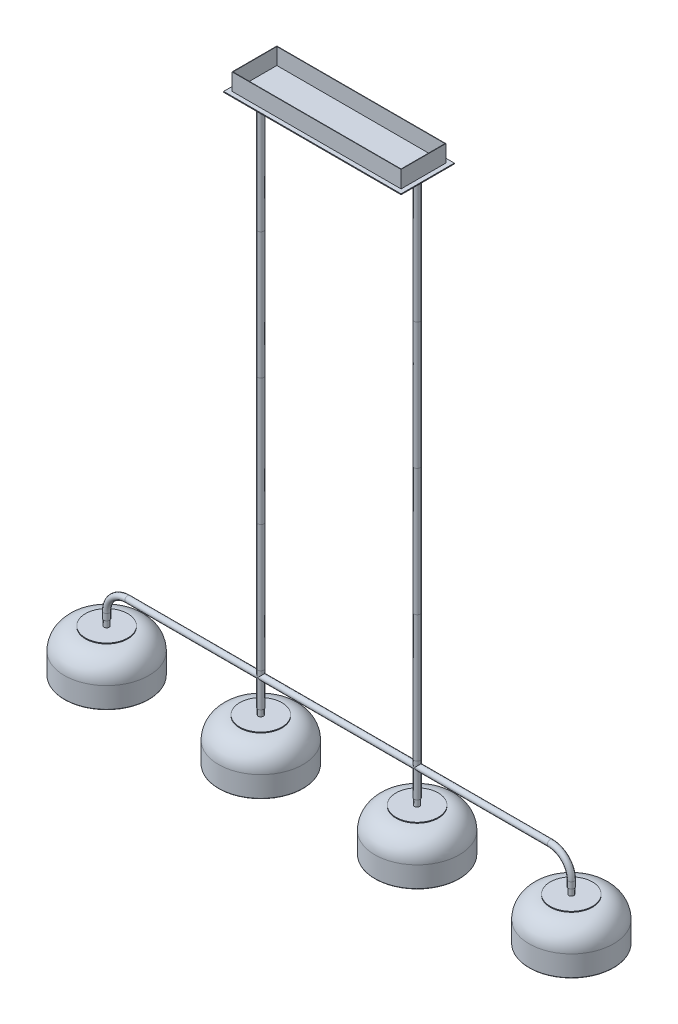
ISO-10303-21;
HEADER;
FILE_DESCRIPTION(('STEP AP214'),'2;1');
FILE_NAME('part.step','',(''),(''),'','','');
FILE_SCHEMA(('AUTOMOTIVE_DESIGN { 1 0 10303 214 1 1 1 1 }'));
ENDSEC;
DATA;
#1=APPLICATION_CONTEXT('core data for automotive mechanical design processes');
#2=APPLICATION_PROTOCOL_DEFINITION('international standard','automotive_design',2000,#1);
#3=PRODUCT_CONTEXT('',#1,'mechanical');
#4=PRODUCT('Part','Part','',(#3));
#5=PRODUCT_RELATED_PRODUCT_CATEGORY('part','',(#4));
#6=PRODUCT_DEFINITION_FORMATION('','',#4);
#7=PRODUCT_DEFINITION_CONTEXT('part definition',#1,'design');
#8=PRODUCT_DEFINITION('design','',#6,#7);
#9=PRODUCT_DEFINITION_SHAPE('','',#8);
#10=(LENGTH_UNIT() NAMED_UNIT(*) SI_UNIT(.MILLI.,.METRE.));
#11=(NAMED_UNIT(*) PLANE_ANGLE_UNIT() SI_UNIT($,.RADIAN.));
#12=(NAMED_UNIT(*) SI_UNIT($,.STERADIAN.) SOLID_ANGLE_UNIT());
#13=UNCERTAINTY_MEASURE_WITH_UNIT(LENGTH_MEASURE(1.E-05),#10,'distance_accuracy_value','');
#14=(GEOMETRIC_REPRESENTATION_CONTEXT(3) GLOBAL_UNCERTAINTY_ASSIGNED_CONTEXT((#13)) GLOBAL_UNIT_ASSIGNED_CONTEXT((#10,
#11,#12)) REPRESENTATION_CONTEXT('',''));
#15=CARTESIAN_POINT('',(0.,0.,0.));
#16=DIRECTION('',(0.,0.,1.));
#17=DIRECTION('',(1.,0.,0.));
#18=AXIS2_PLACEMENT_3D('',#15,#16,#17);
#19=CARTESIAN_POINT('',(-559.994063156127,-608.156165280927,0.));
#20=DIRECTION('',(0.,-1.,0.));
#21=DIRECTION('',(1.,0.,0.));
#22=AXIS2_PLACEMENT_3D('',#19,#20,#21);
#23=PLANE('',#22);
#24=CARTESIAN_POINT('',(-609.994063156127,-608.156165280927,0.));
#25=DIRECTION('',(0.,1.,0.));
#26=DIRECTION('',(-1.,0.,0.));
#27=AXIS2_PLACEMENT_3D('',#24,#25,#26);
#28=CIRCLE('',#27,50.);
#29=CARTESIAN_POINT('',(-659.994063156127,-608.156165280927,0.));
#30=VERTEX_POINT('',#29);
#31=EDGE_CURVE('P0_E30',#30,#30,#28,.T.);
#32=ORIENTED_EDGE('',*,*,#31,.T.);
#33=EDGE_LOOP('',(#32));
#34=FACE_BOUND('',#33,.T.);
#35=ADVANCED_FACE('P0_F15',(#34),#23,.F.);
#36=CARTESIAN_POINT('',(-609.994063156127,-658.156165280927,0.));
#37=DIRECTION('',(0.,1.,0.));
#38=DIRECTION('',(-1.,0.,0.));
#39=AXIS2_PLACEMENT_3D('',#36,#37,#38);
#40=DEGENERATE_TOROIDAL_SURFACE('',#39,50.,50.,.T.);
#41=ORIENTED_EDGE('',*,*,#31,.F.);
#42=EDGE_LOOP('',(#41));
#43=FACE_BOUND('',#42,.T.);
#44=CARTESIAN_POINT('',(-609.994063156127,-658.156165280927,0.));
#45=DIRECTION('',(0.,1.,0.));
#46=DIRECTION('',(-1.,0.,0.));
#47=AXIS2_PLACEMENT_3D('',#44,#45,#46);
#48=CIRCLE('',#47,100.);
#49=CARTESIAN_POINT('',(-709.994063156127,-658.156165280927,0.));
#50=VERTEX_POINT('',#49);
#51=EDGE_CURVE('P0_E36',#50,#50,#48,.T.);
#52=ORIENTED_EDGE('',*,*,#51,.T.);
#53=EDGE_LOOP('',(#52));
#54=FACE_BOUND('',#53,.T.);
#55=ADVANCED_FACE('P0_F63',(#43,#54),#40,.T.);
#56=CARTESIAN_POINT('',(-609.994063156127,-608.156165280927,0.));
#57=DIRECTION('',(0.,1.,0.));
#58=DIRECTION('',(-1.,0.,0.));
#59=AXIS2_PLACEMENT_3D('',#56,#57,#58);
#60=CYLINDRICAL_SURFACE('',#59,100.);
#61=CARTESIAN_POINT('',(-609.994063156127,-706.656165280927,0.));
#62=DIRECTION('',(0.,1.,0.));
#63=DIRECTION('',(-1.,0.,0.));
#64=AXIS2_PLACEMENT_3D('',#61,#62,#63);
#65=CIRCLE('',#64,100.);
#66=CARTESIAN_POINT('',(-709.994063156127,-706.656165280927,0.));
#67=VERTEX_POINT('',#66);
#68=EDGE_CURVE('P0_E24',#67,#67,#65,.T.);
#69=ORIENTED_EDGE('',*,*,#68,.T.);
#70=EDGE_LOOP('',(#69));
#71=FACE_BOUND('',#70,.T.);
#72=ORIENTED_EDGE('',*,*,#51,.F.);
#73=EDGE_LOOP('',(#72));
#74=FACE_BOUND('',#73,.T.);
#75=ADVANCED_FACE('P0_F54',(#71,#74),#60,.T.);
#76=CARTESIAN_POINT('',(-559.994063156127,-611.156165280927,0.));
#77=DIRECTION('',(0.,-1.,0.));
#78=DIRECTION('',(1.,0.,0.));
#79=AXIS2_PLACEMENT_3D('',#76,#77,#78);
#80=PLANE('',#79);
#81=CARTESIAN_POINT('',(-609.994063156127,-611.156165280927,0.));
#82=DIRECTION('',(0.,1.,0.));
#83=DIRECTION('',(-1.,0.,0.));
#84=AXIS2_PLACEMENT_3D('',#81,#82,#83);
#85=CIRCLE('',#84,50.);
#86=CARTESIAN_POINT('',(-659.994063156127,-611.156165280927,0.));
#87=VERTEX_POINT('',#86);
#88=EDGE_CURVE('P0_E40',#87,#87,#85,.T.);
#89=ORIENTED_EDGE('',*,*,#88,.F.);
#90=EDGE_LOOP('',(#89));
#91=FACE_BOUND('',#90,.T.);
#92=ADVANCED_FACE('P0_F52',(#91),#80,.T.);
#93=CARTESIAN_POINT('',(-609.994063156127,-658.156165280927,0.));
#94=DIRECTION('',(0.,1.,0.));
#95=DIRECTION('',(-1.,0.,0.));
#96=AXIS2_PLACEMENT_3D('',#93,#94,#95);
#97=TOROIDAL_SURFACE('',#96,50.,47.);
#98=ORIENTED_EDGE('',*,*,#88,.T.);
#99=EDGE_LOOP('',(#98));
#100=FACE_BOUND('',#99,.T.);
#101=CARTESIAN_POINT('',(-609.994063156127,-658.156165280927,0.));
#102=DIRECTION('',(0.,1.,0.));
#103=DIRECTION('',(-1.,0.,0.));
#104=AXIS2_PLACEMENT_3D('',#101,#102,#103);
#105=CIRCLE('',#104,97.);
#106=CARTESIAN_POINT('',(-706.994063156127,-658.156165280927,0.));
#107=VERTEX_POINT('',#106);
#108=EDGE_CURVE('P0_E41',#107,#107,#105,.T.);
#109=ORIENTED_EDGE('',*,*,#108,.F.);
#110=EDGE_LOOP('',(#109));
#111=FACE_BOUND('',#110,.T.);
#112=ADVANCED_FACE('P0_F49',(#100,#111),#97,.F.);
#113=CARTESIAN_POINT('',(-609.994063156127,-608.156165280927,0.));
#114=DIRECTION('',(0.,1.,0.));
#115=DIRECTION('',(-1.,0.,0.));
#116=AXIS2_PLACEMENT_3D('',#113,#114,#115);
#117=CYLINDRICAL_SURFACE('',#116,97.);
#118=CARTESIAN_POINT('',(-609.994063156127,-706.656165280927,0.));
#119=DIRECTION('',(0.,1.,0.));
#120=DIRECTION('',(-1.,0.,0.));
#121=AXIS2_PLACEMENT_3D('',#118,#119,#120);
#122=CIRCLE('',#121,97.);
#123=CARTESIAN_POINT('',(-706.994063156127,-706.656165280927,0.));
#124=VERTEX_POINT('',#123);
#125=EDGE_CURVE('P0_E10',#124,#124,#122,.F.);
#126=ORIENTED_EDGE('',*,*,#125,.T.);
#127=EDGE_LOOP('',(#126));
#128=FACE_BOUND('',#127,.T.);
#129=ORIENTED_EDGE('',*,*,#108,.T.);
#130=EDGE_LOOP('',(#129));
#131=FACE_BOUND('',#130,.T.);
#132=ADVANCED_FACE('P0_F61',(#128,#131),#117,.F.);
#133=CARTESIAN_POINT('',(-609.994063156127,-706.656165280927,0.));
#134=DIRECTION('',(0.,1.,0.));
#135=DIRECTION('',(-1.,0.,0.));
#136=AXIS2_PLACEMENT_3D('',#133,#134,#135);
#137=TOROIDAL_SURFACE('',#136,98.5,1.5);
#138=ORIENTED_EDGE('',*,*,#125,.F.);
#139=EDGE_LOOP('',(#138));
#140=FACE_BOUND('',#139,.T.);
#141=CARTESIAN_POINT('',(-609.994063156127,-708.156165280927,0.));
#142=DIRECTION('',(0.,1.,0.));
#143=DIRECTION('',(-1.,0.,0.));
#144=AXIS2_PLACEMENT_3D('',#141,#142,#143);
#145=CIRCLE('',#144,98.5);
#146=CARTESIAN_POINT('',(-708.494063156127,-708.156165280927,0.));
#147=VERTEX_POINT('',#146);
#148=EDGE_CURVE('P0_E19',#147,#147,#145,.T.);
#149=ORIENTED_EDGE('',*,*,#148,.F.);
#150=EDGE_LOOP('',(#149));
#151=FACE_BOUND('',#150,.T.);
#152=ADVANCED_FACE('P0_F17',(#140,#151),#137,.T.);
#153=CARTESIAN_POINT('',(-609.994063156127,-706.656165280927,0.));
#154=DIRECTION('',(0.,1.,0.));
#155=DIRECTION('',(-1.,0.,0.));
#156=AXIS2_PLACEMENT_3D('',#153,#154,#155);
#157=TOROIDAL_SURFACE('',#156,98.5,1.5);
#158=ORIENTED_EDGE('',*,*,#148,.T.);
#159=EDGE_LOOP('',(#158));
#160=FACE_BOUND('',#159,.T.);
#161=ORIENTED_EDGE('',*,*,#68,.F.);
#162=EDGE_LOOP('',(#161));
#163=FACE_BOUND('',#162,.T.);
#164=ADVANCED_FACE('P0_F74',(#160,#163),#157,.T.);
#165=CLOSED_SHELL('',(#35,#55,#75,#92,#112,#132,#152,#164));
#166=MANIFOLD_SOLID_BREP('P0_B1',#165);
#167=CARTESIAN_POINT('',(-609.994063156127,-613.156165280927,0.));
#168=DIRECTION('',(0.,1.,0.));
#169=DIRECTION('',(0.,0.,1.));
#170=AXIS2_PLACEMENT_3D('',#167,#168,#169);
#171=CYLINDRICAL_SURFACE('',#170,50.);
#172=CARTESIAN_POINT('',(-609.994063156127,-613.156165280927,0.));
#173=DIRECTION('',(0.,-1.,0.));
#174=DIRECTION('',(0.,0.,-1.));
#175=AXIS2_PLACEMENT_3D('',#172,#173,#174);
#176=CIRCLE('',#175,50.);
#177=CARTESIAN_POINT('',(-609.994063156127,-613.156165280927,-50.));
#178=VERTEX_POINT('',#177);
#179=EDGE_CURVE('P1_E10',#178,#178,#176,.T.);
#180=ORIENTED_EDGE('',*,*,#179,.F.);
#181=EDGE_LOOP('',(#180));
#182=FACE_BOUND('',#181,.T.);
#183=CARTESIAN_POINT('',(-609.994063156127,-611.156165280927,0.));
#184=DIRECTION('',(0.,-1.,0.));
#185=DIRECTION('',(0.,0.,-1.));
#186=AXIS2_PLACEMENT_3D('',#183,#184,#185);
#187=CIRCLE('',#186,50.);
#188=CARTESIAN_POINT('',(-609.994063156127,-611.156165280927,-50.));
#189=VERTEX_POINT('',#188);
#190=EDGE_CURVE('P1_E18',#189,#189,#187,.T.);
#191=ORIENTED_EDGE('',*,*,#190,.T.);
#192=EDGE_LOOP('',(#191));
#193=FACE_BOUND('',#192,.T.);
#194=ADVANCED_FACE('P1_F15',(#182,#193),#171,.T.);
#195=CARTESIAN_POINT('',(-609.994063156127,-613.156165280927,0.));
#196=DIRECTION('',(0.,-1.,0.));
#197=DIRECTION('',(0.,0.,-1.));
#198=AXIS2_PLACEMENT_3D('',#195,#196,#197);
#199=PLANE('',#198);
#200=ORIENTED_EDGE('',*,*,#179,.T.);
#201=EDGE_LOOP('',(#200));
#202=FACE_BOUND('',#201,.T.);
#203=ADVANCED_FACE('P1_F30',(#202),#199,.T.);
#204=CARTESIAN_POINT('',(-609.994063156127,-611.156165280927,0.));
#205=DIRECTION('',(0.,-1.,0.));
#206=DIRECTION('',(0.,0.,-1.));
#207=AXIS2_PLACEMENT_3D('',#204,#205,#206);
#208=PLANE('',#207);
#209=ORIENTED_EDGE('',*,*,#190,.F.);
#210=EDGE_LOOP('',(#209));
#211=FACE_BOUND('',#210,.T.);
#212=ADVANCED_FACE('P1_F28',(#211),#208,.F.);
#213=CLOSED_SHELL('',(#194,#203,#212));
#214=MANIFOLD_SOLID_BREP('P1_B1',#213);
#215=CARTESIAN_POINT('',(-609.994063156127,-633.156165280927,0.));
#216=DIRECTION('',(0.,1.,0.));
#217=DIRECTION('',(0.,0.,1.));
#218=AXIS2_PLACEMENT_3D('',#215,#216,#217);
#219=CYLINDRICAL_SURFACE('',#218,50.);
#220=CARTESIAN_POINT('',(-609.994063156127,-633.156165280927,0.));
#221=DIRECTION('',(0.,-1.,0.));
#222=DIRECTION('',(0.,0.,-1.));
#223=AXIS2_PLACEMENT_3D('',#220,#221,#222);
#224=CIRCLE('',#223,50.);
#225=CARTESIAN_POINT('',(-609.994063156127,-633.156165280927,-50.));
#226=VERTEX_POINT('',#225);
#227=EDGE_CURVE('P2_E10',#226,#226,#224,.T.);
#228=ORIENTED_EDGE('',*,*,#227,.F.);
#229=EDGE_LOOP('',(#228));
#230=FACE_BOUND('',#229,.T.);
#231=CARTESIAN_POINT('',(-609.994063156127,-613.156165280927,0.));
#232=DIRECTION('',(0.,-1.,0.));
#233=DIRECTION('',(0.,0.,-1.));
#234=AXIS2_PLACEMENT_3D('',#231,#232,#233);
#235=CIRCLE('',#234,50.);
#236=CARTESIAN_POINT('',(-609.994063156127,-613.156165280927,-50.));
#237=VERTEX_POINT('',#236);
#238=EDGE_CURVE('P2_E18',#237,#237,#235,.T.);
#239=ORIENTED_EDGE('',*,*,#238,.T.);
#240=EDGE_LOOP('',(#239));
#241=FACE_BOUND('',#240,.T.);
#242=ADVANCED_FACE('P2_F15',(#230,#241),#219,.T.);
#243=CARTESIAN_POINT('',(-609.994063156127,-633.156165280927,0.));
#244=DIRECTION('',(0.,-1.,0.));
#245=DIRECTION('',(0.,0.,-1.));
#246=AXIS2_PLACEMENT_3D('',#243,#244,#245);
#247=PLANE('',#246);
#248=ORIENTED_EDGE('',*,*,#227,.T.);
#249=EDGE_LOOP('',(#248));
#250=FACE_BOUND('',#249,.T.);
#251=ADVANCED_FACE('P2_F30',(#250),#247,.T.);
#252=CARTESIAN_POINT('',(-609.994063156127,-613.156165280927,0.));
#253=DIRECTION('',(0.,-1.,0.));
#254=DIRECTION('',(0.,0.,-1.));
#255=AXIS2_PLACEMENT_3D('',#252,#253,#254);
#256=PLANE('',#255);
#257=ORIENTED_EDGE('',*,*,#238,.F.);
#258=EDGE_LOOP('',(#257));
#259=FACE_BOUND('',#258,.T.);
#260=ADVANCED_FACE('P2_F28',(#259),#256,.F.);
#261=CLOSED_SHELL('',(#242,#251,#260));
#262=MANIFOLD_SOLID_BREP('P2_B1',#261);
#263=CARTESIAN_POINT('',(-609.994063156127,-648.156165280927,0.));
#264=DIRECTION('',(0.,1.,0.));
#265=DIRECTION('',(0.,0.,1.));
#266=AXIS2_PLACEMENT_3D('',#263,#264,#265);
#267=CYLINDRICAL_SURFACE('',#266,50.);
#268=CARTESIAN_POINT('',(-609.994063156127,-638.156165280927,0.));
#269=DIRECTION('',(0.,-1.,0.));
#270=DIRECTION('',(0.,0.,-1.));
#271=AXIS2_PLACEMENT_3D('',#268,#269,#270);
#272=CIRCLE('',#271,50.);
#273=CARTESIAN_POINT('',(-609.994063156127,-638.156165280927,-50.));
#274=VERTEX_POINT('',#273);
#275=EDGE_CURVE('P3_E10',#274,#274,#272,.F.);
#276=ORIENTED_EDGE('',*,*,#275,.T.);
#277=EDGE_LOOP('',(#276));
#278=FACE_BOUND('',#277,.T.);
#279=CARTESIAN_POINT('',(-609.994063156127,-633.156165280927,0.));
#280=DIRECTION('',(0.,-1.,0.));
#281=DIRECTION('',(0.,0.,-1.));
#282=AXIS2_PLACEMENT_3D('',#279,#280,#281);
#283=CIRCLE('',#282,50.);
#284=CARTESIAN_POINT('',(-609.994063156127,-633.156165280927,-50.));
#285=VERTEX_POINT('',#284);
#286=EDGE_CURVE('P3_E26',#285,#285,#283,.T.);
#287=ORIENTED_EDGE('',*,*,#286,.T.);
#288=EDGE_LOOP('',(#287));
#289=FACE_BOUND('',#288,.T.);
#290=ADVANCED_FACE('P3_F15',(#278,#289),#267,.T.);
#291=CARTESIAN_POINT('',(-609.994063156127,-648.156165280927,0.));
#292=DIRECTION('',(0.,-1.,0.));
#293=DIRECTION('',(0.,0.,-1.));
#294=AXIS2_PLACEMENT_3D('',#291,#292,#293);
#295=PLANE('',#294);
#296=CARTESIAN_POINT('',(-609.994063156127,-648.156165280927,0.));
#297=DIRECTION('',(0.,-1.,0.));
#298=DIRECTION('',(0.,0.,-1.));
#299=AXIS2_PLACEMENT_3D('',#296,#297,#298);
#300=CIRCLE('',#299,40.);
#301=CARTESIAN_POINT('',(-609.994063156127,-648.156165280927,-40.));
#302=VERTEX_POINT('',#301);
#303=EDGE_CURVE('P3_E22',#302,#302,#300,.T.);
#304=ORIENTED_EDGE('',*,*,#303,.T.);
#305=EDGE_LOOP('',(#304));
#306=FACE_BOUND('',#305,.T.);
#307=ADVANCED_FACE('P3_F36',(#306),#295,.T.);
#308=CARTESIAN_POINT('',(-609.994063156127,-633.156165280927,0.));
#309=DIRECTION('',(0.,-1.,0.));
#310=DIRECTION('',(0.,0.,-1.));
#311=AXIS2_PLACEMENT_3D('',#308,#309,#310);
#312=PLANE('',#311);
#313=ORIENTED_EDGE('',*,*,#286,.F.);
#314=EDGE_LOOP('',(#313));
#315=FACE_BOUND('',#314,.T.);
#316=ADVANCED_FACE('P3_F34',(#315),#312,.F.);
#317=CARTESIAN_POINT('',(-609.994063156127,-638.156165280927,0.));
#318=DIRECTION('',(0.,-1.,0.));
#319=DIRECTION('',(0.,0.,-1.));
#320=AXIS2_PLACEMENT_3D('',#317,#318,#319);
#321=TOROIDAL_SURFACE('',#320,40.,10.);
#322=ORIENTED_EDGE('',*,*,#275,.F.);
#323=EDGE_LOOP('',(#322));
#324=FACE_BOUND('',#323,.T.);
#325=ORIENTED_EDGE('',*,*,#303,.F.);
#326=EDGE_LOOP('',(#325));
#327=FACE_BOUND('',#326,.T.);
#328=ADVANCED_FACE('P3_F17',(#324,#327),#321,.T.);
#329=CLOSED_SHELL('',(#290,#307,#316,#328));
#330=MANIFOLD_SOLID_BREP('P3_B1',#329);
#331=CARTESIAN_POINT('',(-609.994063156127,-606.156165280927,0.));
#332=DIRECTION('',(0.,-1.,0.));
#333=DIRECTION('',(0.,0.,-1.));
#334=AXIS2_PLACEMENT_3D('',#331,#332,#333);
#335=CYLINDRICAL_SURFACE('',#334,50.);
#336=CARTESIAN_POINT('',(-609.994063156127,-606.156165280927,0.));
#337=DIRECTION('',(0.,1.,0.));
#338=DIRECTION('',(0.,0.,1.));
#339=AXIS2_PLACEMENT_3D('',#336,#337,#338);
#340=CIRCLE('',#339,50.);
#341=CARTESIAN_POINT('',(-609.994063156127,-606.156165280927,50.));
#342=VERTEX_POINT('',#341);
#343=EDGE_CURVE('P4_E10',#342,#342,#340,.T.);
#344=ORIENTED_EDGE('',*,*,#343,.F.);
#345=EDGE_LOOP('',(#344));
#346=FACE_BOUND('',#345,.T.);
#347=CARTESIAN_POINT('',(-609.994063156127,-608.156165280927,0.));
#348=DIRECTION('',(0.,1.,0.));
#349=DIRECTION('',(0.,0.,1.));
#350=AXIS2_PLACEMENT_3D('',#347,#348,#349);
#351=CIRCLE('',#350,50.);
#352=CARTESIAN_POINT('',(-609.994063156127,-608.156165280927,50.));
#353=VERTEX_POINT('',#352);
#354=EDGE_CURVE('P4_E18',#353,#353,#351,.T.);
#355=ORIENTED_EDGE('',*,*,#354,.T.);
#356=EDGE_LOOP('',(#355));
#357=FACE_BOUND('',#356,.T.);
#358=ADVANCED_FACE('P4_F15',(#346,#357),#335,.T.);
#359=CARTESIAN_POINT('',(-609.994063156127,-606.156165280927,0.));
#360=DIRECTION('',(0.,1.,0.));
#361=DIRECTION('',(0.,0.,1.));
#362=AXIS2_PLACEMENT_3D('',#359,#360,#361);
#363=PLANE('',#362);
#364=CARTESIAN_POINT('',(-609.994063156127,-606.156165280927,0.));
#365=DIRECTION('',(0.,1.,0.));
#366=DIRECTION('',(0.,0.,1.));
#367=AXIS2_PLACEMENT_3D('',#364,#365,#366);
#368=CIRCLE('',#367,6.);
#369=CARTESIAN_POINT('',(-609.994063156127,-606.156165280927,5.99999999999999));
#370=VERTEX_POINT('',#369);
#371=EDGE_CURVE('P4_E27',#370,#370,#368,.T.);
#372=ORIENTED_EDGE('',*,*,#371,.F.);
#373=EDGE_LOOP('',(#372));
#374=FACE_BOUND('',#373,.T.);
#375=ORIENTED_EDGE('',*,*,#343,.T.);
#376=EDGE_LOOP('',(#375));
#377=FACE_BOUND('',#376,.T.);
#378=ADVANCED_FACE('P4_F42',(#374,#377),#363,.T.);
#379=CARTESIAN_POINT('',(-609.994063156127,-608.156165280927,0.));
#380=DIRECTION('',(0.,1.,0.));
#381=DIRECTION('',(0.,0.,1.));
#382=AXIS2_PLACEMENT_3D('',#379,#380,#381);
#383=PLANE('',#382);
#384=ORIENTED_EDGE('',*,*,#354,.F.);
#385=EDGE_LOOP('',(#384));
#386=FACE_BOUND('',#385,.T.);
#387=ADVANCED_FACE('P4_F38',(#386),#383,.F.);
#388=CARTESIAN_POINT('',(-609.994063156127,-591.156165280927,0.));
#389=DIRECTION('',(0.,-1.,0.));
#390=DIRECTION('',(0.,0.,-1.));
#391=AXIS2_PLACEMENT_3D('',#388,#389,#390);
#392=CYLINDRICAL_SURFACE('',#391,6.);
#393=CARTESIAN_POINT('',(-609.994063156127,-591.156165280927,0.));
#394=DIRECTION('',(0.,1.,0.));
#395=DIRECTION('',(0.,0.,1.));
#396=AXIS2_PLACEMENT_3D('',#393,#394,#395);
#397=CIRCLE('',#396,6.);
#398=CARTESIAN_POINT('',(-609.994063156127,-591.156165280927,5.99999999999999));
#399=VERTEX_POINT('',#398);
#400=EDGE_CURVE('P4_E25',#399,#399,#397,.T.);
#401=ORIENTED_EDGE('',*,*,#400,.F.);
#402=EDGE_LOOP('',(#401));
#403=FACE_BOUND('',#402,.T.);
#404=ORIENTED_EDGE('',*,*,#371,.T.);
#405=EDGE_LOOP('',(#404));
#406=FACE_BOUND('',#405,.T.);
#407=ADVANCED_FACE('P4_F35',(#403,#406),#392,.T.);
#408=CARTESIAN_POINT('',(-609.994063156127,-591.156165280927,0.));
#409=DIRECTION('',(0.,1.,0.));
#410=DIRECTION('',(0.,0.,1.));
#411=AXIS2_PLACEMENT_3D('',#408,#409,#410);
#412=PLANE('',#411);
#413=ORIENTED_EDGE('',*,*,#400,.T.);
#414=EDGE_LOOP('',(#413));
#415=FACE_BOUND('',#414,.T.);
#416=ADVANCED_FACE('P4_F33',(#415),#412,.T.);
#417=CLOSED_SHELL('',(#358,#378,#387,#407,#416));
#418=MANIFOLD_SOLID_BREP('P4_B1',#417);
#419=CARTESIAN_POINT('',(-194.994063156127,-608.156165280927,0.));
#420=DIRECTION('',(0.,-1.,0.));
#421=DIRECTION('',(1.,0.,0.));
#422=AXIS2_PLACEMENT_3D('',#419,#420,#421);
#423=PLANE('',#422);
#424=CARTESIAN_POINT('',(-244.994063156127,-608.156165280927,0.));
#425=DIRECTION('',(0.,1.,0.));
#426=DIRECTION('',(-1.,0.,0.));
#427=AXIS2_PLACEMENT_3D('',#424,#425,#426);
#428=CIRCLE('',#427,50.);
#429=CARTESIAN_POINT('',(-294.994063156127,-608.156165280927,0.));
#430=VERTEX_POINT('',#429);
#431=EDGE_CURVE('P5_E27',#430,#430,#428,.T.);
#432=ORIENTED_EDGE('',*,*,#431,.T.);
#433=EDGE_LOOP('',(#432));
#434=FACE_BOUND('',#433,.T.);
#435=ADVANCED_FACE('P5_F15',(#434),#423,.F.);
#436=CARTESIAN_POINT('',(-244.994063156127,-658.156165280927,0.));
#437=DIRECTION('',(0.,1.,0.));
#438=DIRECTION('',(-1.,0.,0.));
#439=AXIS2_PLACEMENT_3D('',#436,#437,#438);
#440=DEGENERATE_TOROIDAL_SURFACE('',#439,50.,50.,.T.);
#441=ORIENTED_EDGE('',*,*,#431,.F.);
#442=EDGE_LOOP('',(#441));
#443=FACE_BOUND('',#442,.T.);
#444=CARTESIAN_POINT('',(-244.994063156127,-658.156165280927,0.));
#445=DIRECTION('',(0.,1.,0.));
#446=DIRECTION('',(-1.,0.,0.));
#447=AXIS2_PLACEMENT_3D('',#444,#445,#446);
#448=CIRCLE('',#447,100.);
#449=CARTESIAN_POINT('',(-344.994063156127,-658.156165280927,0.));
#450=VERTEX_POINT('',#449);
#451=EDGE_CURVE('P5_E32',#450,#450,#448,.T.);
#452=ORIENTED_EDGE('',*,*,#451,.T.);
#453=EDGE_LOOP('',(#452));
#454=FACE_BOUND('',#453,.T.);
#455=ADVANCED_FACE('P5_F56',(#443,#454),#440,.T.);
#456=CARTESIAN_POINT('',(-244.994063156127,-608.156165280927,0.));
#457=DIRECTION('',(0.,1.,0.));
#458=DIRECTION('',(-1.,0.,0.));
#459=AXIS2_PLACEMENT_3D('',#456,#457,#458);
#460=CYLINDRICAL_SURFACE('',#459,100.);
#461=CARTESIAN_POINT('',(-244.994063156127,-706.656165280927,0.));
#462=DIRECTION('',(0.,1.,0.));
#463=DIRECTION('',(-1.,0.,0.));
#464=AXIS2_PLACEMENT_3D('',#461,#462,#463);
#465=CIRCLE('',#464,100.);
#466=CARTESIAN_POINT('',(-344.994063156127,-706.656165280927,0.));
#467=VERTEX_POINT('',#466);
#468=EDGE_CURVE('P5_E23',#467,#467,#465,.T.);
#469=ORIENTED_EDGE('',*,*,#468,.T.);
#470=EDGE_LOOP('',(#469));
#471=FACE_BOUND('',#470,.T.);
#472=ORIENTED_EDGE('',*,*,#451,.F.);
#473=EDGE_LOOP('',(#472));
#474=FACE_BOUND('',#473,.T.);
#475=ADVANCED_FACE('P5_F47',(#471,#474),#460,.T.);
#476=CARTESIAN_POINT('',(-194.994063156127,-611.156165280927,0.));
#477=DIRECTION('',(0.,-1.,0.));
#478=DIRECTION('',(1.,0.,0.));
#479=AXIS2_PLACEMENT_3D('',#476,#477,#478);
#480=PLANE('',#479);
#481=CARTESIAN_POINT('',(-244.994063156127,-611.156165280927,0.));
#482=DIRECTION('',(0.,1.,0.));
#483=DIRECTION('',(-1.,0.,0.));
#484=AXIS2_PLACEMENT_3D('',#481,#482,#483);
#485=CIRCLE('',#484,50.);
#486=CARTESIAN_POINT('',(-294.994063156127,-611.156165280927,0.));
#487=VERTEX_POINT('',#486);
#488=EDGE_CURVE('P5_E35',#487,#487,#485,.T.);
#489=ORIENTED_EDGE('',*,*,#488,.F.);
#490=EDGE_LOOP('',(#489));
#491=FACE_BOUND('',#490,.T.);
#492=ADVANCED_FACE('P5_F45',(#491),#480,.T.);
#493=CARTESIAN_POINT('',(-244.994063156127,-658.156165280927,0.));
#494=DIRECTION('',(0.,1.,0.));
#495=DIRECTION('',(-1.,0.,0.));
#496=AXIS2_PLACEMENT_3D('',#493,#494,#495);
#497=TOROIDAL_SURFACE('',#496,50.,47.);
#498=ORIENTED_EDGE('',*,*,#488,.T.);
#499=EDGE_LOOP('',(#498));
#500=FACE_BOUND('',#499,.T.);
#501=CARTESIAN_POINT('',(-244.994063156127,-658.156165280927,0.));
#502=DIRECTION('',(0.,1.,0.));
#503=DIRECTION('',(-1.,0.,0.));
#504=AXIS2_PLACEMENT_3D('',#501,#502,#503);
#505=CIRCLE('',#504,97.);
#506=CARTESIAN_POINT('',(-341.994063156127,-658.156165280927,0.));
#507=VERTEX_POINT('',#506);
#508=EDGE_CURVE('P5_E36',#507,#507,#505,.T.);
#509=ORIENTED_EDGE('',*,*,#508,.F.);
#510=EDGE_LOOP('',(#509));
#511=FACE_BOUND('',#510,.T.);
#512=ADVANCED_FACE('P5_F42',(#500,#511),#497,.F.);
#513=CARTESIAN_POINT('',(-244.994063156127,-608.156165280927,0.));
#514=DIRECTION('',(0.,1.,0.));
#515=DIRECTION('',(-1.,0.,0.));
#516=AXIS2_PLACEMENT_3D('',#513,#514,#515);
#517=CYLINDRICAL_SURFACE('',#516,97.);
#518=CARTESIAN_POINT('',(-244.994063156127,-706.656165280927,0.));
#519=DIRECTION('',(0.,1.,0.));
#520=DIRECTION('',(-1.,0.,0.));
#521=AXIS2_PLACEMENT_3D('',#518,#519,#520);
#522=CIRCLE('',#521,97.);
#523=CARTESIAN_POINT('',(-341.994063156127,-706.656165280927,0.));
#524=VERTEX_POINT('',#523);
#525=EDGE_CURVE('P5_E10',#524,#524,#522,.F.);
#526=ORIENTED_EDGE('',*,*,#525,.T.);
#527=EDGE_LOOP('',(#526));
#528=FACE_BOUND('',#527,.T.);
#529=ORIENTED_EDGE('',*,*,#508,.T.);
#530=EDGE_LOOP('',(#529));
#531=FACE_BOUND('',#530,.T.);
#532=ADVANCED_FACE('P5_F54',(#528,#531),#517,.F.);
#533=CARTESIAN_POINT('',(-244.994063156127,-706.656165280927,0.));
#534=DIRECTION('',(0.,1.,0.));
#535=DIRECTION('',(-1.,0.,0.));
#536=AXIS2_PLACEMENT_3D('',#533,#534,#535);
#537=TOROIDAL_SURFACE('',#536,98.5,1.5);
#538=ORIENTED_EDGE('',*,*,#525,.F.);
#539=EDGE_LOOP('',(#538));
#540=FACE_BOUND('',#539,.T.);
#541=CARTESIAN_POINT('',(-244.994063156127,-708.156165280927,0.));
#542=DIRECTION('',(0.,1.,0.));
#543=DIRECTION('',(-1.,0.,0.));
#544=AXIS2_PLACEMENT_3D('',#541,#542,#543);
#545=CIRCLE('',#544,98.5);
#546=CARTESIAN_POINT('',(-343.494063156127,-708.156165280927,0.));
#547=VERTEX_POINT('',#546);
#548=EDGE_CURVE('P5_E19',#547,#547,#545,.T.);
#549=ORIENTED_EDGE('',*,*,#548,.F.);
#550=EDGE_LOOP('',(#549));
#551=FACE_BOUND('',#550,.T.);
#552=ADVANCED_FACE('P5_F17',(#540,#551),#537,.T.);
#553=CARTESIAN_POINT('',(-244.994063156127,-706.656165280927,0.));
#554=DIRECTION('',(0.,1.,0.));
#555=DIRECTION('',(-1.,0.,0.));
#556=AXIS2_PLACEMENT_3D('',#553,#554,#555);
#557=TOROIDAL_SURFACE('',#556,98.5,1.5);
#558=ORIENTED_EDGE('',*,*,#548,.T.);
#559=EDGE_LOOP('',(#558));
#560=FACE_BOUND('',#559,.T.);
#561=ORIENTED_EDGE('',*,*,#468,.F.);
#562=EDGE_LOOP('',(#561));
#563=FACE_BOUND('',#562,.T.);
#564=ADVANCED_FACE('P5_F67',(#560,#563),#557,.T.);
#565=CLOSED_SHELL('',(#435,#455,#475,#492,#512,#532,#552,#564));
#566=MANIFOLD_SOLID_BREP('P5_B1',#565);
#567=CARTESIAN_POINT('',(-244.994063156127,-613.156165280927,0.));
#568=DIRECTION('',(0.,1.,0.));
#569=DIRECTION('',(0.,0.,1.));
#570=AXIS2_PLACEMENT_3D('',#567,#568,#569);
#571=CYLINDRICAL_SURFACE('',#570,50.);
#572=CARTESIAN_POINT('',(-244.994063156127,-613.156165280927,0.));
#573=DIRECTION('',(0.,-1.,0.));
#574=DIRECTION('',(0.,0.,-1.));
#575=AXIS2_PLACEMENT_3D('',#572,#573,#574);
#576=CIRCLE('',#575,50.);
#577=CARTESIAN_POINT('',(-244.994063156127,-613.156165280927,-50.));
#578=VERTEX_POINT('',#577);
#579=EDGE_CURVE('P6_E10',#578,#578,#576,.T.);
#580=ORIENTED_EDGE('',*,*,#579,.F.);
#581=EDGE_LOOP('',(#580));
#582=FACE_BOUND('',#581,.T.);
#583=CARTESIAN_POINT('',(-244.994063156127,-611.156165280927,0.));
#584=DIRECTION('',(0.,-1.,0.));
#585=DIRECTION('',(0.,0.,-1.));
#586=AXIS2_PLACEMENT_3D('',#583,#584,#585);
#587=CIRCLE('',#586,50.);
#588=CARTESIAN_POINT('',(-244.994063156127,-611.156165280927,-50.));
#589=VERTEX_POINT('',#588);
#590=EDGE_CURVE('P6_E18',#589,#589,#587,.T.);
#591=ORIENTED_EDGE('',*,*,#590,.T.);
#592=EDGE_LOOP('',(#591));
#593=FACE_BOUND('',#592,.T.);
#594=ADVANCED_FACE('P6_F15',(#582,#593),#571,.T.);
#595=CARTESIAN_POINT('',(-244.994063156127,-613.156165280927,0.));
#596=DIRECTION('',(0.,-1.,0.));
#597=DIRECTION('',(0.,0.,-1.));
#598=AXIS2_PLACEMENT_3D('',#595,#596,#597);
#599=PLANE('',#598);
#600=ORIENTED_EDGE('',*,*,#579,.T.);
#601=EDGE_LOOP('',(#600));
#602=FACE_BOUND('',#601,.T.);
#603=ADVANCED_FACE('P6_F30',(#602),#599,.T.);
#604=CARTESIAN_POINT('',(-244.994063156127,-611.156165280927,0.));
#605=DIRECTION('',(0.,-1.,0.));
#606=DIRECTION('',(0.,0.,-1.));
#607=AXIS2_PLACEMENT_3D('',#604,#605,#606);
#608=PLANE('',#607);
#609=ORIENTED_EDGE('',*,*,#590,.F.);
#610=EDGE_LOOP('',(#609));
#611=FACE_BOUND('',#610,.T.);
#612=ADVANCED_FACE('P6_F28',(#611),#608,.F.);
#613=CLOSED_SHELL('',(#594,#603,#612));
#614=MANIFOLD_SOLID_BREP('P6_B1',#613);
#615=CARTESIAN_POINT('',(-244.994063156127,-633.156165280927,0.));
#616=DIRECTION('',(0.,1.,0.));
#617=DIRECTION('',(0.,0.,1.));
#618=AXIS2_PLACEMENT_3D('',#615,#616,#617);
#619=CYLINDRICAL_SURFACE('',#618,50.);
#620=CARTESIAN_POINT('',(-244.994063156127,-633.156165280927,0.));
#621=DIRECTION('',(0.,-1.,0.));
#622=DIRECTION('',(0.,0.,-1.));
#623=AXIS2_PLACEMENT_3D('',#620,#621,#622);
#624=CIRCLE('',#623,50.);
#625=CARTESIAN_POINT('',(-244.994063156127,-633.156165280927,-50.));
#626=VERTEX_POINT('',#625);
#627=EDGE_CURVE('P7_E10',#626,#626,#624,.T.);
#628=ORIENTED_EDGE('',*,*,#627,.F.);
#629=EDGE_LOOP('',(#628));
#630=FACE_BOUND('',#629,.T.);
#631=CARTESIAN_POINT('',(-244.994063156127,-613.156165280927,0.));
#632=DIRECTION('',(0.,-1.,0.));
#633=DIRECTION('',(0.,0.,-1.));
#634=AXIS2_PLACEMENT_3D('',#631,#632,#633);
#635=CIRCLE('',#634,50.);
#636=CARTESIAN_POINT('',(-244.994063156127,-613.156165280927,-50.));
#637=VERTEX_POINT('',#636);
#638=EDGE_CURVE('P7_E18',#637,#637,#635,.T.);
#639=ORIENTED_EDGE('',*,*,#638,.T.);
#640=EDGE_LOOP('',(#639));
#641=FACE_BOUND('',#640,.T.);
#642=ADVANCED_FACE('P7_F15',(#630,#641),#619,.T.);
#643=CARTESIAN_POINT('',(-244.994063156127,-633.156165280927,0.));
#644=DIRECTION('',(0.,-1.,0.));
#645=DIRECTION('',(0.,0.,-1.));
#646=AXIS2_PLACEMENT_3D('',#643,#644,#645);
#647=PLANE('',#646);
#648=ORIENTED_EDGE('',*,*,#627,.T.);
#649=EDGE_LOOP('',(#648));
#650=FACE_BOUND('',#649,.T.);
#651=ADVANCED_FACE('P7_F30',(#650),#647,.T.);
#652=CARTESIAN_POINT('',(-244.994063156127,-613.156165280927,0.));
#653=DIRECTION('',(0.,-1.,0.));
#654=DIRECTION('',(0.,0.,-1.));
#655=AXIS2_PLACEMENT_3D('',#652,#653,#654);
#656=PLANE('',#655);
#657=ORIENTED_EDGE('',*,*,#638,.F.);
#658=EDGE_LOOP('',(#657));
#659=FACE_BOUND('',#658,.T.);
#660=ADVANCED_FACE('P7_F28',(#659),#656,.F.);
#661=CLOSED_SHELL('',(#642,#651,#660));
#662=MANIFOLD_SOLID_BREP('P7_B1',#661);
#663=CARTESIAN_POINT('',(-244.994063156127,-648.156165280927,0.));
#664=DIRECTION('',(0.,1.,0.));
#665=DIRECTION('',(0.,0.,1.));
#666=AXIS2_PLACEMENT_3D('',#663,#664,#665);
#667=CYLINDRICAL_SURFACE('',#666,50.);
#668=CARTESIAN_POINT('',(-244.994063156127,-638.156165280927,0.));
#669=DIRECTION('',(0.,-1.,0.));
#670=DIRECTION('',(0.,0.,-1.));
#671=AXIS2_PLACEMENT_3D('',#668,#669,#670);
#672=CIRCLE('',#671,50.);
#673=CARTESIAN_POINT('',(-244.994063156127,-638.156165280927,-50.));
#674=VERTEX_POINT('',#673);
#675=EDGE_CURVE('P8_E10',#674,#674,#672,.F.);
#676=ORIENTED_EDGE('',*,*,#675,.T.);
#677=EDGE_LOOP('',(#676));
#678=FACE_BOUND('',#677,.T.);
#679=CARTESIAN_POINT('',(-244.994063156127,-633.156165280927,0.));
#680=DIRECTION('',(0.,-1.,0.));
#681=DIRECTION('',(0.,0.,-1.));
#682=AXIS2_PLACEMENT_3D('',#679,#680,#681);
#683=CIRCLE('',#682,50.);
#684=CARTESIAN_POINT('',(-244.994063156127,-633.156165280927,-50.));
#685=VERTEX_POINT('',#684);
#686=EDGE_CURVE('P8_E26',#685,#685,#683,.T.);
#687=ORIENTED_EDGE('',*,*,#686,.T.);
#688=EDGE_LOOP('',(#687));
#689=FACE_BOUND('',#688,.T.);
#690=ADVANCED_FACE('P8_F15',(#678,#689),#667,.T.);
#691=CARTESIAN_POINT('',(-244.994063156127,-648.156165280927,0.));
#692=DIRECTION('',(0.,-1.,0.));
#693=DIRECTION('',(0.,0.,-1.));
#694=AXIS2_PLACEMENT_3D('',#691,#692,#693);
#695=PLANE('',#694);
#696=CARTESIAN_POINT('',(-244.994063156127,-648.156165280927,0.));
#697=DIRECTION('',(0.,-1.,0.));
#698=DIRECTION('',(0.,0.,-1.));
#699=AXIS2_PLACEMENT_3D('',#696,#697,#698);
#700=CIRCLE('',#699,40.);
#701=CARTESIAN_POINT('',(-244.994063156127,-648.156165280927,-40.));
#702=VERTEX_POINT('',#701);
#703=EDGE_CURVE('P8_E22',#702,#702,#700,.T.);
#704=ORIENTED_EDGE('',*,*,#703,.T.);
#705=EDGE_LOOP('',(#704));
#706=FACE_BOUND('',#705,.T.);
#707=ADVANCED_FACE('P8_F36',(#706),#695,.T.);
#708=CARTESIAN_POINT('',(-244.994063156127,-633.156165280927,0.));
#709=DIRECTION('',(0.,-1.,0.));
#710=DIRECTION('',(0.,0.,-1.));
#711=AXIS2_PLACEMENT_3D('',#708,#709,#710);
#712=PLANE('',#711);
#713=ORIENTED_EDGE('',*,*,#686,.F.);
#714=EDGE_LOOP('',(#713));
#715=FACE_BOUND('',#714,.T.);
#716=ADVANCED_FACE('P8_F34',(#715),#712,.F.);
#717=CARTESIAN_POINT('',(-244.994063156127,-638.156165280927,0.));
#718=DIRECTION('',(0.,-1.,0.));
#719=DIRECTION('',(0.,0.,-1.));
#720=AXIS2_PLACEMENT_3D('',#717,#718,#719);
#721=TOROIDAL_SURFACE('',#720,40.,10.);
#722=ORIENTED_EDGE('',*,*,#675,.F.);
#723=EDGE_LOOP('',(#722));
#724=FACE_BOUND('',#723,.T.);
#725=ORIENTED_EDGE('',*,*,#703,.F.);
#726=EDGE_LOOP('',(#725));
#727=FACE_BOUND('',#726,.T.);
#728=ADVANCED_FACE('P8_F17',(#724,#727),#721,.T.);
#729=CLOSED_SHELL('',(#690,#707,#716,#728));
#730=MANIFOLD_SOLID_BREP('P8_B1',#729);
#731=CARTESIAN_POINT('',(-244.994063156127,-606.156165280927,0.));
#732=DIRECTION('',(0.,-1.,0.));
#733=DIRECTION('',(0.,0.,-1.));
#734=AXIS2_PLACEMENT_3D('',#731,#732,#733);
#735=CYLINDRICAL_SURFACE('',#734,50.);
#736=CARTESIAN_POINT('',(-244.994063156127,-606.156165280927,0.));
#737=DIRECTION('',(0.,1.,0.));
#738=DIRECTION('',(0.,0.,1.));
#739=AXIS2_PLACEMENT_3D('',#736,#737,#738);
#740=CIRCLE('',#739,50.);
#741=CARTESIAN_POINT('',(-244.994063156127,-606.156165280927,50.));
#742=VERTEX_POINT('',#741);
#743=EDGE_CURVE('P9_E10',#742,#742,#740,.T.);
#744=ORIENTED_EDGE('',*,*,#743,.F.);
#745=EDGE_LOOP('',(#744));
#746=FACE_BOUND('',#745,.T.);
#747=CARTESIAN_POINT('',(-244.994063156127,-608.156165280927,0.));
#748=DIRECTION('',(0.,1.,0.));
#749=DIRECTION('',(0.,0.,1.));
#750=AXIS2_PLACEMENT_3D('',#747,#748,#749);
#751=CIRCLE('',#750,50.);
#752=CARTESIAN_POINT('',(-244.994063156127,-608.156165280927,50.));
#753=VERTEX_POINT('',#752);
#754=EDGE_CURVE('P9_E18',#753,#753,#751,.T.);
#755=ORIENTED_EDGE('',*,*,#754,.T.);
#756=EDGE_LOOP('',(#755));
#757=FACE_BOUND('',#756,.T.);
#758=ADVANCED_FACE('P9_F15',(#746,#757),#735,.T.);
#759=CARTESIAN_POINT('',(-244.994063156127,-606.156165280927,0.));
#760=DIRECTION('',(0.,1.,0.));
#761=DIRECTION('',(0.,0.,1.));
#762=AXIS2_PLACEMENT_3D('',#759,#760,#761);
#763=PLANE('',#762);
#764=CARTESIAN_POINT('',(-244.994063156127,-606.156165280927,0.));
#765=DIRECTION('',(0.,1.,0.));
#766=DIRECTION('',(0.,0.,1.));
#767=AXIS2_PLACEMENT_3D('',#764,#765,#766);
#768=CIRCLE('',#767,6.);
#769=CARTESIAN_POINT('',(-244.994063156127,-606.156165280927,5.99999999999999));
#770=VERTEX_POINT('',#769);
#771=EDGE_CURVE('P9_E27',#770,#770,#768,.T.);
#772=ORIENTED_EDGE('',*,*,#771,.F.);
#773=EDGE_LOOP('',(#772));
#774=FACE_BOUND('',#773,.T.);
#775=ORIENTED_EDGE('',*,*,#743,.T.);
#776=EDGE_LOOP('',(#775));
#777=FACE_BOUND('',#776,.T.);
#778=ADVANCED_FACE('P9_F42',(#774,#777),#763,.T.);
#779=CARTESIAN_POINT('',(-244.994063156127,-608.156165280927,0.));
#780=DIRECTION('',(0.,1.,0.));
#781=DIRECTION('',(0.,0.,1.));
#782=AXIS2_PLACEMENT_3D('',#779,#780,#781);
#783=PLANE('',#782);
#784=ORIENTED_EDGE('',*,*,#754,.F.);
#785=EDGE_LOOP('',(#784));
#786=FACE_BOUND('',#785,.T.);
#787=ADVANCED_FACE('P9_F38',(#786),#783,.F.);
#788=CARTESIAN_POINT('',(-244.994063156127,-591.156165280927,0.));
#789=DIRECTION('',(0.,-1.,0.));
#790=DIRECTION('',(0.,0.,-1.));
#791=AXIS2_PLACEMENT_3D('',#788,#789,#790);
#792=CYLINDRICAL_SURFACE('',#791,6.);
#793=CARTESIAN_POINT('',(-244.994063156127,-591.156165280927,0.));
#794=DIRECTION('',(0.,1.,0.));
#795=DIRECTION('',(0.,0.,1.));
#796=AXIS2_PLACEMENT_3D('',#793,#794,#795);
#797=CIRCLE('',#796,6.);
#798=CARTESIAN_POINT('',(-244.994063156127,-591.156165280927,5.99999999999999));
#799=VERTEX_POINT('',#798);
#800=EDGE_CURVE('P9_E25',#799,#799,#797,.T.);
#801=ORIENTED_EDGE('',*,*,#800,.F.);
#802=EDGE_LOOP('',(#801));
#803=FACE_BOUND('',#802,.T.);
#804=ORIENTED_EDGE('',*,*,#771,.T.);
#805=EDGE_LOOP('',(#804));
#806=FACE_BOUND('',#805,.T.);
#807=ADVANCED_FACE('P9_F35',(#803,#806),#792,.T.);
#808=CARTESIAN_POINT('',(-244.994063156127,-591.156165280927,0.));
#809=DIRECTION('',(0.,1.,0.));
#810=DIRECTION('',(0.,0.,1.));
#811=AXIS2_PLACEMENT_3D('',#808,#809,#810);
#812=PLANE('',#811);
#813=ORIENTED_EDGE('',*,*,#800,.T.);
#814=EDGE_LOOP('',(#813));
#815=FACE_BOUND('',#814,.T.);
#816=ADVANCED_FACE('P9_F33',(#815),#812,.T.);
#817=CLOSED_SHELL('',(#758,#778,#787,#807,#816));
#818=MANIFOLD_SOLID_BREP('P9_B1',#817);
#819=CARTESIAN_POINT('',(175.005936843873,-608.156165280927,0.));
#820=DIRECTION('',(0.,-1.,0.));
#821=DIRECTION('',(1.,0.,0.));
#822=AXIS2_PLACEMENT_3D('',#819,#820,#821);
#823=PLANE('',#822);
#824=CARTESIAN_POINT('',(125.005936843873,-608.156165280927,0.));
#825=DIRECTION('',(0.,1.,0.));
#826=DIRECTION('',(-1.,0.,0.));
#827=AXIS2_PLACEMENT_3D('',#824,#825,#826);
#828=CIRCLE('',#827,50.);
#829=CARTESIAN_POINT('',(75.0059368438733,-608.156165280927,0.));
#830=VERTEX_POINT('',#829);
#831=EDGE_CURVE('P10_E27',#830,#830,#828,.T.);
#832=ORIENTED_EDGE('',*,*,#831,.T.);
#833=EDGE_LOOP('',(#832));
#834=FACE_BOUND('',#833,.T.);
#835=ADVANCED_FACE('P10_F15',(#834),#823,.F.);
#836=CARTESIAN_POINT('',(125.005936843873,-658.156165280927,0.));
#837=DIRECTION('',(0.,1.,0.));
#838=DIRECTION('',(-1.,0.,0.));
#839=AXIS2_PLACEMENT_3D('',#836,#837,#838);
#840=DEGENERATE_TOROIDAL_SURFACE('',#839,50.,50.,.T.);
#841=ORIENTED_EDGE('',*,*,#831,.F.);
#842=EDGE_LOOP('',(#841));
#843=FACE_BOUND('',#842,.T.);
#844=CARTESIAN_POINT('',(125.005936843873,-658.156165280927,0.));
#845=DIRECTION('',(0.,1.,0.));
#846=DIRECTION('',(-1.,0.,0.));
#847=AXIS2_PLACEMENT_3D('',#844,#845,#846);
#848=CIRCLE('',#847,100.);
#849=CARTESIAN_POINT('',(25.0059368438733,-658.156165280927,0.));
#850=VERTEX_POINT('',#849);
#851=EDGE_CURVE('P10_E32',#850,#850,#848,.T.);
#852=ORIENTED_EDGE('',*,*,#851,.T.);
#853=EDGE_LOOP('',(#852));
#854=FACE_BOUND('',#853,.T.);
#855=ADVANCED_FACE('P10_F56',(#843,#854),#840,.T.);
#856=CARTESIAN_POINT('',(125.005936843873,-608.156165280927,0.));
#857=DIRECTION('',(0.,1.,0.));
#858=DIRECTION('',(-1.,0.,0.));
#859=AXIS2_PLACEMENT_3D('',#856,#857,#858);
#860=CYLINDRICAL_SURFACE('',#859,100.);
#861=CARTESIAN_POINT('',(125.005936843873,-706.656165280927,0.));
#862=DIRECTION('',(0.,1.,0.));
#863=DIRECTION('',(-1.,0.,0.));
#864=AXIS2_PLACEMENT_3D('',#861,#862,#863);
#865=CIRCLE('',#864,100.);
#866=CARTESIAN_POINT('',(25.0059368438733,-706.656165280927,0.));
#867=VERTEX_POINT('',#866);
#868=EDGE_CURVE('P10_E23',#867,#867,#865,.T.);
#869=ORIENTED_EDGE('',*,*,#868,.T.);
#870=EDGE_LOOP('',(#869));
#871=FACE_BOUND('',#870,.T.);
#872=ORIENTED_EDGE('',*,*,#851,.F.);
#873=EDGE_LOOP('',(#872));
#874=FACE_BOUND('',#873,.T.);
#875=ADVANCED_FACE('P10_F47',(#871,#874),#860,.T.);
#876=CARTESIAN_POINT('',(175.005936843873,-611.156165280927,0.));
#877=DIRECTION('',(0.,-1.,0.));
#878=DIRECTION('',(1.,0.,0.));
#879=AXIS2_PLACEMENT_3D('',#876,#877,#878);
#880=PLANE('',#879);
#881=CARTESIAN_POINT('',(125.005936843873,-611.156165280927,0.));
#882=DIRECTION('',(0.,1.,0.));
#883=DIRECTION('',(-1.,0.,0.));
#884=AXIS2_PLACEMENT_3D('',#881,#882,#883);
#885=CIRCLE('',#884,50.);
#886=CARTESIAN_POINT('',(75.0059368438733,-611.156165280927,0.));
#887=VERTEX_POINT('',#886);
#888=EDGE_CURVE('P10_E35',#887,#887,#885,.T.);
#889=ORIENTED_EDGE('',*,*,#888,.F.);
#890=EDGE_LOOP('',(#889));
#891=FACE_BOUND('',#890,.T.);
#892=ADVANCED_FACE('P10_F45',(#891),#880,.T.);
#893=CARTESIAN_POINT('',(125.005936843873,-658.156165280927,0.));
#894=DIRECTION('',(0.,1.,0.));
#895=DIRECTION('',(-1.,0.,0.));
#896=AXIS2_PLACEMENT_3D('',#893,#894,#895);
#897=TOROIDAL_SURFACE('',#896,50.,47.);
#898=ORIENTED_EDGE('',*,*,#888,.T.);
#899=EDGE_LOOP('',(#898));
#900=FACE_BOUND('',#899,.T.);
#901=CARTESIAN_POINT('',(125.005936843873,-658.156165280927,0.));
#902=DIRECTION('',(0.,1.,0.));
#903=DIRECTION('',(-1.,0.,0.));
#904=AXIS2_PLACEMENT_3D('',#901,#902,#903);
#905=CIRCLE('',#904,97.);
#906=CARTESIAN_POINT('',(28.0059368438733,-658.156165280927,0.));
#907=VERTEX_POINT('',#906);
#908=EDGE_CURVE('P10_E36',#907,#907,#905,.T.);
#909=ORIENTED_EDGE('',*,*,#908,.F.);
#910=EDGE_LOOP('',(#909));
#911=FACE_BOUND('',#910,.T.);
#912=ADVANCED_FACE('P10_F42',(#900,#911),#897,.F.);
#913=CARTESIAN_POINT('',(125.005936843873,-608.156165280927,0.));
#914=DIRECTION('',(0.,1.,0.));
#915=DIRECTION('',(-1.,0.,0.));
#916=AXIS2_PLACEMENT_3D('',#913,#914,#915);
#917=CYLINDRICAL_SURFACE('',#916,97.);
#918=CARTESIAN_POINT('',(125.005936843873,-706.656165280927,0.));
#919=DIRECTION('',(0.,1.,0.));
#920=DIRECTION('',(-1.,0.,0.));
#921=AXIS2_PLACEMENT_3D('',#918,#919,#920);
#922=CIRCLE('',#921,97.);
#923=CARTESIAN_POINT('',(28.0059368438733,-706.656165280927,0.));
#924=VERTEX_POINT('',#923);
#925=EDGE_CURVE('P10_E10',#924,#924,#922,.F.);
#926=ORIENTED_EDGE('',*,*,#925,.T.);
#927=EDGE_LOOP('',(#926));
#928=FACE_BOUND('',#927,.T.);
#929=ORIENTED_EDGE('',*,*,#908,.T.);
#930=EDGE_LOOP('',(#929));
#931=FACE_BOUND('',#930,.T.);
#932=ADVANCED_FACE('P10_F54',(#928,#931),#917,.F.);
#933=CARTESIAN_POINT('',(125.005936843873,-706.656165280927,0.));
#934=DIRECTION('',(0.,1.,0.));
#935=DIRECTION('',(-1.,0.,0.));
#936=AXIS2_PLACEMENT_3D('',#933,#934,#935);
#937=TOROIDAL_SURFACE('',#936,98.5,1.5);
#938=ORIENTED_EDGE('',*,*,#925,.F.);
#939=EDGE_LOOP('',(#938));
#940=FACE_BOUND('',#939,.T.);
#941=CARTESIAN_POINT('',(125.005936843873,-708.156165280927,0.));
#942=DIRECTION('',(0.,1.,0.));
#943=DIRECTION('',(-1.,0.,0.));
#944=AXIS2_PLACEMENT_3D('',#941,#942,#943);
#945=CIRCLE('',#944,98.5);
#946=CARTESIAN_POINT('',(26.5059368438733,-708.156165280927,0.));
#947=VERTEX_POINT('',#946);
#948=EDGE_CURVE('P10_E19',#947,#947,#945,.T.);
#949=ORIENTED_EDGE('',*,*,#948,.F.);
#950=EDGE_LOOP('',(#949));
#951=FACE_BOUND('',#950,.T.);
#952=ADVANCED_FACE('P10_F17',(#940,#951),#937,.T.);
#953=CARTESIAN_POINT('',(125.005936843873,-706.656165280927,0.));
#954=DIRECTION('',(0.,1.,0.));
#955=DIRECTION('',(-1.,0.,0.));
#956=AXIS2_PLACEMENT_3D('',#953,#954,#955);
#957=TOROIDAL_SURFACE('',#956,98.5,1.5);
#958=ORIENTED_EDGE('',*,*,#948,.T.);
#959=EDGE_LOOP('',(#958));
#960=FACE_BOUND('',#959,.T.);
#961=ORIENTED_EDGE('',*,*,#868,.F.);
#962=EDGE_LOOP('',(#961));
#963=FACE_BOUND('',#962,.T.);
#964=ADVANCED_FACE('P10_F67',(#960,#963),#957,.T.);
#965=CLOSED_SHELL('',(#835,#855,#875,#892,#912,#932,#952,#964));
#966=MANIFOLD_SOLID_BREP('P10_B1',#965);
#967=CARTESIAN_POINT('',(125.005936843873,-613.156165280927,0.));
#968=DIRECTION('',(0.,1.,0.));
#969=DIRECTION('',(0.,0.,1.));
#970=AXIS2_PLACEMENT_3D('',#967,#968,#969);
#971=CYLINDRICAL_SURFACE('',#970,50.);
#972=CARTESIAN_POINT('',(125.005936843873,-613.156165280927,0.));
#973=DIRECTION('',(0.,-1.,0.));
#974=DIRECTION('',(0.,0.,-1.));
#975=AXIS2_PLACEMENT_3D('',#972,#973,#974);
#976=CIRCLE('',#975,50.);
#977=CARTESIAN_POINT('',(125.005936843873,-613.156165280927,-50.));
#978=VERTEX_POINT('',#977);
#979=EDGE_CURVE('P11_E10',#978,#978,#976,.T.);
#980=ORIENTED_EDGE('',*,*,#979,.F.);
#981=EDGE_LOOP('',(#980));
#982=FACE_BOUND('',#981,.T.);
#983=CARTESIAN_POINT('',(125.005936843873,-611.156165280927,0.));
#984=DIRECTION('',(0.,-1.,0.));
#985=DIRECTION('',(0.,0.,-1.));
#986=AXIS2_PLACEMENT_3D('',#983,#984,#985);
#987=CIRCLE('',#986,50.);
#988=CARTESIAN_POINT('',(125.005936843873,-611.156165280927,-50.));
#989=VERTEX_POINT('',#988);
#990=EDGE_CURVE('P11_E18',#989,#989,#987,.T.);
#991=ORIENTED_EDGE('',*,*,#990,.T.);
#992=EDGE_LOOP('',(#991));
#993=FACE_BOUND('',#992,.T.);
#994=ADVANCED_FACE('P11_F15',(#982,#993),#971,.T.);
#995=CARTESIAN_POINT('',(125.005936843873,-613.156165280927,0.));
#996=DIRECTION('',(0.,-1.,0.));
#997=DIRECTION('',(0.,0.,-1.));
#998=AXIS2_PLACEMENT_3D('',#995,#996,#997);
#999=PLANE('',#998);
#1000=ORIENTED_EDGE('',*,*,#979,.T.);
#1001=EDGE_LOOP('',(#1000));
#1002=FACE_BOUND('',#1001,.T.);
#1003=ADVANCED_FACE('P11_F30',(#1002),#999,.T.);
#1004=CARTESIAN_POINT('',(125.005936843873,-611.156165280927,0.));
#1005=DIRECTION('',(0.,-1.,0.));
#1006=DIRECTION('',(0.,0.,-1.));
#1007=AXIS2_PLACEMENT_3D('',#1004,#1005,#1006);
#1008=PLANE('',#1007);
#1009=ORIENTED_EDGE('',*,*,#990,.F.);
#1010=EDGE_LOOP('',(#1009));
#1011=FACE_BOUND('',#1010,.T.);
#1012=ADVANCED_FACE('P11_F28',(#1011),#1008,.F.);
#1013=CLOSED_SHELL('',(#994,#1003,#1012));
#1014=MANIFOLD_SOLID_BREP('P11_B1',#1013);
#1015=CARTESIAN_POINT('',(125.005936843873,-633.156165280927,0.));
#1016=DIRECTION('',(0.,1.,0.));
#1017=DIRECTION('',(0.,0.,1.));
#1018=AXIS2_PLACEMENT_3D('',#1015,#1016,#1017);
#1019=CYLINDRICAL_SURFACE('',#1018,50.);
#1020=CARTESIAN_POINT('',(125.005936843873,-633.156165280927,0.));
#1021=DIRECTION('',(0.,-1.,0.));
#1022=DIRECTION('',(0.,0.,-1.));
#1023=AXIS2_PLACEMENT_3D('',#1020,#1021,#1022);
#1024=CIRCLE('',#1023,50.);
#1025=CARTESIAN_POINT('',(125.005936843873,-633.156165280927,-50.));
#1026=VERTEX_POINT('',#1025);
#1027=EDGE_CURVE('P12_E10',#1026,#1026,#1024,.T.);
#1028=ORIENTED_EDGE('',*,*,#1027,.F.);
#1029=EDGE_LOOP('',(#1028));
#1030=FACE_BOUND('',#1029,.T.);
#1031=CARTESIAN_POINT('',(125.005936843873,-613.156165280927,0.));
#1032=DIRECTION('',(0.,-1.,0.));
#1033=DIRECTION('',(0.,0.,-1.));
#1034=AXIS2_PLACEMENT_3D('',#1031,#1032,#1033);
#1035=CIRCLE('',#1034,50.);
#1036=CARTESIAN_POINT('',(125.005936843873,-613.156165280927,-50.));
#1037=VERTEX_POINT('',#1036);
#1038=EDGE_CURVE('P12_E18',#1037,#1037,#1035,.T.);
#1039=ORIENTED_EDGE('',*,*,#1038,.T.);
#1040=EDGE_LOOP('',(#1039));
#1041=FACE_BOUND('',#1040,.T.);
#1042=ADVANCED_FACE('P12_F15',(#1030,#1041),#1019,.T.);
#1043=CARTESIAN_POINT('',(125.005936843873,-633.156165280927,0.));
#1044=DIRECTION('',(0.,-1.,0.));
#1045=DIRECTION('',(0.,0.,-1.));
#1046=AXIS2_PLACEMENT_3D('',#1043,#1044,#1045);
#1047=PLANE('',#1046);
#1048=ORIENTED_EDGE('',*,*,#1027,.T.);
#1049=EDGE_LOOP('',(#1048));
#1050=FACE_BOUND('',#1049,.T.);
#1051=ADVANCED_FACE('P12_F30',(#1050),#1047,.T.);
#1052=CARTESIAN_POINT('',(125.005936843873,-613.156165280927,0.));
#1053=DIRECTION('',(0.,-1.,0.));
#1054=DIRECTION('',(0.,0.,-1.));
#1055=AXIS2_PLACEMENT_3D('',#1052,#1053,#1054);
#1056=PLANE('',#1055);
#1057=ORIENTED_EDGE('',*,*,#1038,.F.);
#1058=EDGE_LOOP('',(#1057));
#1059=FACE_BOUND('',#1058,.T.);
#1060=ADVANCED_FACE('P12_F28',(#1059),#1056,.F.);
#1061=CLOSED_SHELL('',(#1042,#1051,#1060));
#1062=MANIFOLD_SOLID_BREP('P12_B1',#1061);
#1063=CARTESIAN_POINT('',(125.005936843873,-648.156165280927,0.));
#1064=DIRECTION('',(0.,1.,0.));
#1065=DIRECTION('',(0.,0.,1.));
#1066=AXIS2_PLACEMENT_3D('',#1063,#1064,#1065);
#1067=CYLINDRICAL_SURFACE('',#1066,50.);
#1068=CARTESIAN_POINT('',(125.005936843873,-638.156165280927,0.));
#1069=DIRECTION('',(0.,-1.,0.));
#1070=DIRECTION('',(0.,0.,-1.));
#1071=AXIS2_PLACEMENT_3D('',#1068,#1069,#1070);
#1072=CIRCLE('',#1071,50.);
#1073=CARTESIAN_POINT('',(125.005936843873,-638.156165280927,-50.));
#1074=VERTEX_POINT('',#1073);
#1075=EDGE_CURVE('P13_E10',#1074,#1074,#1072,.F.);
#1076=ORIENTED_EDGE('',*,*,#1075,.T.);
#1077=EDGE_LOOP('',(#1076));
#1078=FACE_BOUND('',#1077,.T.);
#1079=CARTESIAN_POINT('',(125.005936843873,-633.156165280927,0.));
#1080=DIRECTION('',(0.,-1.,0.));
#1081=DIRECTION('',(0.,0.,-1.));
#1082=AXIS2_PLACEMENT_3D('',#1079,#1080,#1081);
#1083=CIRCLE('',#1082,50.);
#1084=CARTESIAN_POINT('',(125.005936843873,-633.156165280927,-50.));
#1085=VERTEX_POINT('',#1084);
#1086=EDGE_CURVE('P13_E26',#1085,#1085,#1083,.T.);
#1087=ORIENTED_EDGE('',*,*,#1086,.T.);
#1088=EDGE_LOOP('',(#1087));
#1089=FACE_BOUND('',#1088,.T.);
#1090=ADVANCED_FACE('P13_F15',(#1078,#1089),#1067,.T.);
#1091=CARTESIAN_POINT('',(125.005936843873,-648.156165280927,0.));
#1092=DIRECTION('',(0.,-1.,0.));
#1093=DIRECTION('',(0.,0.,-1.));
#1094=AXIS2_PLACEMENT_3D('',#1091,#1092,#1093);
#1095=PLANE('',#1094);
#1096=CARTESIAN_POINT('',(125.005936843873,-648.156165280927,0.));
#1097=DIRECTION('',(0.,-1.,0.));
#1098=DIRECTION('',(0.,0.,-1.));
#1099=AXIS2_PLACEMENT_3D('',#1096,#1097,#1098);
#1100=CIRCLE('',#1099,40.);
#1101=CARTESIAN_POINT('',(125.005936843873,-648.156165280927,-40.));
#1102=VERTEX_POINT('',#1101);
#1103=EDGE_CURVE('P13_E22',#1102,#1102,#1100,.T.);
#1104=ORIENTED_EDGE('',*,*,#1103,.T.);
#1105=EDGE_LOOP('',(#1104));
#1106=FACE_BOUND('',#1105,.T.);
#1107=ADVANCED_FACE('P13_F36',(#1106),#1095,.T.);
#1108=CARTESIAN_POINT('',(125.005936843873,-633.156165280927,0.));
#1109=DIRECTION('',(0.,-1.,0.));
#1110=DIRECTION('',(0.,0.,-1.));
#1111=AXIS2_PLACEMENT_3D('',#1108,#1109,#1110);
#1112=PLANE('',#1111);
#1113=ORIENTED_EDGE('',*,*,#1086,.F.);
#1114=EDGE_LOOP('',(#1113));
#1115=FACE_BOUND('',#1114,.T.);
#1116=ADVANCED_FACE('P13_F34',(#1115),#1112,.F.);
#1117=CARTESIAN_POINT('',(125.005936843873,-638.156165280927,0.));
#1118=DIRECTION('',(0.,-1.,0.));
#1119=DIRECTION('',(0.,0.,-1.));
#1120=AXIS2_PLACEMENT_3D('',#1117,#1118,#1119);
#1121=TOROIDAL_SURFACE('',#1120,40.,10.);
#1122=ORIENTED_EDGE('',*,*,#1075,.F.);
#1123=EDGE_LOOP('',(#1122));
#1124=FACE_BOUND('',#1123,.T.);
#1125=ORIENTED_EDGE('',*,*,#1103,.F.);
#1126=EDGE_LOOP('',(#1125));
#1127=FACE_BOUND('',#1126,.T.);
#1128=ADVANCED_FACE('P13_F17',(#1124,#1127),#1121,.T.);
#1129=CLOSED_SHELL('',(#1090,#1107,#1116,#1128));
#1130=MANIFOLD_SOLID_BREP('P13_B1',#1129);
#1131=CARTESIAN_POINT('',(125.005936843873,-606.156165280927,0.));
#1132=DIRECTION('',(0.,-1.,0.));
#1133=DIRECTION('',(0.,0.,-1.));
#1134=AXIS2_PLACEMENT_3D('',#1131,#1132,#1133);
#1135=CYLINDRICAL_SURFACE('',#1134,50.);
#1136=CARTESIAN_POINT('',(125.005936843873,-606.156165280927,0.));
#1137=DIRECTION('',(0.,1.,0.));
#1138=DIRECTION('',(0.,0.,1.));
#1139=AXIS2_PLACEMENT_3D('',#1136,#1137,#1138);
#1140=CIRCLE('',#1139,50.);
#1141=CARTESIAN_POINT('',(125.005936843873,-606.156165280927,50.));
#1142=VERTEX_POINT('',#1141);
#1143=EDGE_CURVE('P14_E10',#1142,#1142,#1140,.T.);
#1144=ORIENTED_EDGE('',*,*,#1143,.F.);
#1145=EDGE_LOOP('',(#1144));
#1146=FACE_BOUND('',#1145,.T.);
#1147=CARTESIAN_POINT('',(125.005936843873,-608.156165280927,0.));
#1148=DIRECTION('',(0.,1.,0.));
#1149=DIRECTION('',(0.,0.,1.));
#1150=AXIS2_PLACEMENT_3D('',#1147,#1148,#1149);
#1151=CIRCLE('',#1150,50.);
#1152=CARTESIAN_POINT('',(125.005936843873,-608.156165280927,50.));
#1153=VERTEX_POINT('',#1152);
#1154=EDGE_CURVE('P14_E18',#1153,#1153,#1151,.T.);
#1155=ORIENTED_EDGE('',*,*,#1154,.T.);
#1156=EDGE_LOOP('',(#1155));
#1157=FACE_BOUND('',#1156,.T.);
#1158=ADVANCED_FACE('P14_F15',(#1146,#1157),#1135,.T.);
#1159=CARTESIAN_POINT('',(125.005936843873,-606.156165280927,0.));
#1160=DIRECTION('',(0.,1.,0.));
#1161=DIRECTION('',(0.,0.,1.));
#1162=AXIS2_PLACEMENT_3D('',#1159,#1160,#1161);
#1163=PLANE('',#1162);
#1164=CARTESIAN_POINT('',(125.005936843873,-606.156165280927,0.));
#1165=DIRECTION('',(0.,1.,0.));
#1166=DIRECTION('',(0.,0.,1.));
#1167=AXIS2_PLACEMENT_3D('',#1164,#1165,#1166);
#1168=CIRCLE('',#1167,6.);
#1169=CARTESIAN_POINT('',(125.005936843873,-606.156165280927,6.));
#1170=VERTEX_POINT('',#1169);
#1171=EDGE_CURVE('P14_E27',#1170,#1170,#1168,.T.);
#1172=ORIENTED_EDGE('',*,*,#1171,.F.);
#1173=EDGE_LOOP('',(#1172));
#1174=FACE_BOUND('',#1173,.T.);
#1175=ORIENTED_EDGE('',*,*,#1143,.T.);
#1176=EDGE_LOOP('',(#1175));
#1177=FACE_BOUND('',#1176,.T.);
#1178=ADVANCED_FACE('P14_F42',(#1174,#1177),#1163,.T.);
#1179=CARTESIAN_POINT('',(125.005936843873,-608.156165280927,0.));
#1180=DIRECTION('',(0.,1.,0.));
#1181=DIRECTION('',(0.,0.,1.));
#1182=AXIS2_PLACEMENT_3D('',#1179,#1180,#1181);
#1183=PLANE('',#1182);
#1184=ORIENTED_EDGE('',*,*,#1154,.F.);
#1185=EDGE_LOOP('',(#1184));
#1186=FACE_BOUND('',#1185,.T.);
#1187=ADVANCED_FACE('P14_F38',(#1186),#1183,.F.);
#1188=CARTESIAN_POINT('',(125.005936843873,-591.156165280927,0.));
#1189=DIRECTION('',(0.,-1.,0.));
#1190=DIRECTION('',(0.,0.,-1.));
#1191=AXIS2_PLACEMENT_3D('',#1188,#1189,#1190);
#1192=CYLINDRICAL_SURFACE('',#1191,6.);
#1193=CARTESIAN_POINT('',(125.005936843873,-591.156165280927,0.));
#1194=DIRECTION('',(0.,1.,0.));
#1195=DIRECTION('',(0.,0.,1.));
#1196=AXIS2_PLACEMENT_3D('',#1193,#1194,#1195);
#1197=CIRCLE('',#1196,6.);
#1198=CARTESIAN_POINT('',(125.005936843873,-591.156165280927,6.));
#1199=VERTEX_POINT('',#1198);
#1200=EDGE_CURVE('P14_E25',#1199,#1199,#1197,.T.);
#1201=ORIENTED_EDGE('',*,*,#1200,.F.);
#1202=EDGE_LOOP('',(#1201));
#1203=FACE_BOUND('',#1202,.T.);
#1204=ORIENTED_EDGE('',*,*,#1171,.T.);
#1205=EDGE_LOOP('',(#1204));
#1206=FACE_BOUND('',#1205,.T.);
#1207=ADVANCED_FACE('P14_F35',(#1203,#1206),#1192,.T.);
#1208=CARTESIAN_POINT('',(125.005936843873,-591.156165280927,0.));
#1209=DIRECTION('',(0.,1.,0.));
#1210=DIRECTION('',(0.,0.,1.));
#1211=AXIS2_PLACEMENT_3D('',#1208,#1209,#1210);
#1212=PLANE('',#1211);
#1213=ORIENTED_EDGE('',*,*,#1200,.T.);
#1214=EDGE_LOOP('',(#1213));
#1215=FACE_BOUND('',#1214,.T.);
#1216=ADVANCED_FACE('P14_F33',(#1215),#1212,.T.);
#1217=CLOSED_SHELL('',(#1158,#1178,#1187,#1207,#1216));
#1218=MANIFOLD_SOLID_BREP('P14_B1',#1217);
#1219=CARTESIAN_POINT('',(540.005936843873,-608.156165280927,0.));
#1220=DIRECTION('',(0.,-1.,0.));
#1221=DIRECTION('',(1.,0.,0.));
#1222=AXIS2_PLACEMENT_3D('',#1219,#1220,#1221);
#1223=PLANE('',#1222);
#1224=CARTESIAN_POINT('',(490.005936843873,-608.156165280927,0.));
#1225=DIRECTION('',(0.,1.,0.));
#1226=DIRECTION('',(-1.,0.,0.));
#1227=AXIS2_PLACEMENT_3D('',#1224,#1225,#1226);
#1228=CIRCLE('',#1227,50.);
#1229=CARTESIAN_POINT('',(440.005936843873,-608.156165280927,0.));
#1230=VERTEX_POINT('',#1229);
#1231=EDGE_CURVE('P15_E27',#1230,#1230,#1228,.T.);
#1232=ORIENTED_EDGE('',*,*,#1231,.T.);
#1233=EDGE_LOOP('',(#1232));
#1234=FACE_BOUND('',#1233,.T.);
#1235=ADVANCED_FACE('P15_F15',(#1234),#1223,.F.);
#1236=CARTESIAN_POINT('',(490.005936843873,-658.156165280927,0.));
#1237=DIRECTION('',(0.,1.,0.));
#1238=DIRECTION('',(-1.,0.,0.));
#1239=AXIS2_PLACEMENT_3D('',#1236,#1237,#1238);
#1240=DEGENERATE_TOROIDAL_SURFACE('',#1239,50.,50.,.T.);
#1241=ORIENTED_EDGE('',*,*,#1231,.F.);
#1242=EDGE_LOOP('',(#1241));
#1243=FACE_BOUND('',#1242,.T.);
#1244=CARTESIAN_POINT('',(490.005936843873,-658.156165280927,0.));
#1245=DIRECTION('',(0.,1.,0.));
#1246=DIRECTION('',(-1.,0.,0.));
#1247=AXIS2_PLACEMENT_3D('',#1244,#1245,#1246);
#1248=CIRCLE('',#1247,100.);
#1249=CARTESIAN_POINT('',(390.005936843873,-658.156165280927,0.));
#1250=VERTEX_POINT('',#1249);
#1251=EDGE_CURVE('P15_E32',#1250,#1250,#1248,.T.);
#1252=ORIENTED_EDGE('',*,*,#1251,.T.);
#1253=EDGE_LOOP('',(#1252));
#1254=FACE_BOUND('',#1253,.T.);
#1255=ADVANCED_FACE('P15_F56',(#1243,#1254),#1240,.T.);
#1256=CARTESIAN_POINT('',(490.005936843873,-608.156165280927,0.));
#1257=DIRECTION('',(0.,1.,0.));
#1258=DIRECTION('',(-1.,0.,0.));
#1259=AXIS2_PLACEMENT_3D('',#1256,#1257,#1258);
#1260=CYLINDRICAL_SURFACE('',#1259,100.);
#1261=CARTESIAN_POINT('',(490.005936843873,-706.656165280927,0.));
#1262=DIRECTION('',(0.,1.,0.));
#1263=DIRECTION('',(-1.,0.,0.));
#1264=AXIS2_PLACEMENT_3D('',#1261,#1262,#1263);
#1265=CIRCLE('',#1264,100.);
#1266=CARTESIAN_POINT('',(390.005936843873,-706.656165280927,0.));
#1267=VERTEX_POINT('',#1266);
#1268=EDGE_CURVE('P15_E23',#1267,#1267,#1265,.T.);
#1269=ORIENTED_EDGE('',*,*,#1268,.T.);
#1270=EDGE_LOOP('',(#1269));
#1271=FACE_BOUND('',#1270,.T.);
#1272=ORIENTED_EDGE('',*,*,#1251,.F.);
#1273=EDGE_LOOP('',(#1272));
#1274=FACE_BOUND('',#1273,.T.);
#1275=ADVANCED_FACE('P15_F47',(#1271,#1274),#1260,.T.);
#1276=CARTESIAN_POINT('',(540.005936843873,-611.156165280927,0.));
#1277=DIRECTION('',(0.,-1.,0.));
#1278=DIRECTION('',(1.,0.,0.));
#1279=AXIS2_PLACEMENT_3D('',#1276,#1277,#1278);
#1280=PLANE('',#1279);
#1281=CARTESIAN_POINT('',(490.005936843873,-611.156165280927,0.));
#1282=DIRECTION('',(0.,1.,0.));
#1283=DIRECTION('',(-1.,0.,0.));
#1284=AXIS2_PLACEMENT_3D('',#1281,#1282,#1283);
#1285=CIRCLE('',#1284,50.);
#1286=CARTESIAN_POINT('',(440.005936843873,-611.156165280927,0.));
#1287=VERTEX_POINT('',#1286);
#1288=EDGE_CURVE('P15_E35',#1287,#1287,#1285,.T.);
#1289=ORIENTED_EDGE('',*,*,#1288,.F.);
#1290=EDGE_LOOP('',(#1289));
#1291=FACE_BOUND('',#1290,.T.);
#1292=ADVANCED_FACE('P15_F45',(#1291),#1280,.T.);
#1293=CARTESIAN_POINT('',(490.005936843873,-658.156165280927,0.));
#1294=DIRECTION('',(0.,1.,0.));
#1295=DIRECTION('',(-1.,0.,0.));
#1296=AXIS2_PLACEMENT_3D('',#1293,#1294,#1295);
#1297=TOROIDAL_SURFACE('',#1296,50.,47.);
#1298=ORIENTED_EDGE('',*,*,#1288,.T.);
#1299=EDGE_LOOP('',(#1298));
#1300=FACE_BOUND('',#1299,.T.);
#1301=CARTESIAN_POINT('',(490.005936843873,-658.156165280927,0.));
#1302=DIRECTION('',(0.,1.,0.));
#1303=DIRECTION('',(-1.,0.,0.));
#1304=AXIS2_PLACEMENT_3D('',#1301,#1302,#1303);
#1305=CIRCLE('',#1304,97.);
#1306=CARTESIAN_POINT('',(393.005936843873,-658.156165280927,0.));
#1307=VERTEX_POINT('',#1306);
#1308=EDGE_CURVE('P15_E36',#1307,#1307,#1305,.T.);
#1309=ORIENTED_EDGE('',*,*,#1308,.F.);
#1310=EDGE_LOOP('',(#1309));
#1311=FACE_BOUND('',#1310,.T.);
#1312=ADVANCED_FACE('P15_F42',(#1300,#1311),#1297,.F.);
#1313=CARTESIAN_POINT('',(490.005936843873,-608.156165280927,0.));
#1314=DIRECTION('',(0.,1.,0.));
#1315=DIRECTION('',(-1.,0.,0.));
#1316=AXIS2_PLACEMENT_3D('',#1313,#1314,#1315);
#1317=CYLINDRICAL_SURFACE('',#1316,97.);
#1318=CARTESIAN_POINT('',(490.005936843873,-706.656165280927,0.));
#1319=DIRECTION('',(0.,1.,0.));
#1320=DIRECTION('',(-1.,0.,0.));
#1321=AXIS2_PLACEMENT_3D('',#1318,#1319,#1320);
#1322=CIRCLE('',#1321,97.);
#1323=CARTESIAN_POINT('',(393.005936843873,-706.656165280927,0.));
#1324=VERTEX_POINT('',#1323);
#1325=EDGE_CURVE('P15_E10',#1324,#1324,#1322,.F.);
#1326=ORIENTED_EDGE('',*,*,#1325,.T.);
#1327=EDGE_LOOP('',(#1326));
#1328=FACE_BOUND('',#1327,.T.);
#1329=ORIENTED_EDGE('',*,*,#1308,.T.);
#1330=EDGE_LOOP('',(#1329));
#1331=FACE_BOUND('',#1330,.T.);
#1332=ADVANCED_FACE('P15_F54',(#1328,#1331),#1317,.F.);
#1333=CARTESIAN_POINT('',(490.005936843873,-706.656165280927,0.));
#1334=DIRECTION('',(0.,1.,0.));
#1335=DIRECTION('',(-1.,0.,0.));
#1336=AXIS2_PLACEMENT_3D('',#1333,#1334,#1335);
#1337=TOROIDAL_SURFACE('',#1336,98.5,1.5);
#1338=ORIENTED_EDGE('',*,*,#1325,.F.);
#1339=EDGE_LOOP('',(#1338));
#1340=FACE_BOUND('',#1339,.T.);
#1341=CARTESIAN_POINT('',(490.005936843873,-708.156165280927,0.));
#1342=DIRECTION('',(0.,1.,0.));
#1343=DIRECTION('',(-1.,0.,0.));
#1344=AXIS2_PLACEMENT_3D('',#1341,#1342,#1343);
#1345=CIRCLE('',#1344,98.5);
#1346=CARTESIAN_POINT('',(391.505936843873,-708.156165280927,0.));
#1347=VERTEX_POINT('',#1346);
#1348=EDGE_CURVE('P15_E19',#1347,#1347,#1345,.T.);
#1349=ORIENTED_EDGE('',*,*,#1348,.F.);
#1350=EDGE_LOOP('',(#1349));
#1351=FACE_BOUND('',#1350,.T.);
#1352=ADVANCED_FACE('P15_F17',(#1340,#1351),#1337,.T.);
#1353=CARTESIAN_POINT('',(490.005936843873,-706.656165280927,0.));
#1354=DIRECTION('',(0.,1.,0.));
#1355=DIRECTION('',(-1.,0.,0.));
#1356=AXIS2_PLACEMENT_3D('',#1353,#1354,#1355);
#1357=TOROIDAL_SURFACE('',#1356,98.5,1.5);
#1358=ORIENTED_EDGE('',*,*,#1348,.T.);
#1359=EDGE_LOOP('',(#1358));
#1360=FACE_BOUND('',#1359,.T.);
#1361=ORIENTED_EDGE('',*,*,#1268,.F.);
#1362=EDGE_LOOP('',(#1361));
#1363=FACE_BOUND('',#1362,.T.);
#1364=ADVANCED_FACE('P15_F67',(#1360,#1363),#1357,.T.);
#1365=CLOSED_SHELL('',(#1235,#1255,#1275,#1292,#1312,#1332,#1352,#1364));
#1366=MANIFOLD_SOLID_BREP('P15_B1',#1365);
#1367=CARTESIAN_POINT('',(490.005936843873,-613.156165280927,0.));
#1368=DIRECTION('',(0.,1.,0.));
#1369=DIRECTION('',(0.,0.,1.));
#1370=AXIS2_PLACEMENT_3D('',#1367,#1368,#1369);
#1371=CYLINDRICAL_SURFACE('',#1370,50.);
#1372=CARTESIAN_POINT('',(490.005936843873,-613.156165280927,0.));
#1373=DIRECTION('',(0.,-1.,0.));
#1374=DIRECTION('',(0.,0.,-1.));
#1375=AXIS2_PLACEMENT_3D('',#1372,#1373,#1374);
#1376=CIRCLE('',#1375,50.);
#1377=CARTESIAN_POINT('',(490.005936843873,-613.156165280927,-50.));
#1378=VERTEX_POINT('',#1377);
#1379=EDGE_CURVE('P16_E10',#1378,#1378,#1376,.T.);
#1380=ORIENTED_EDGE('',*,*,#1379,.F.);
#1381=EDGE_LOOP('',(#1380));
#1382=FACE_BOUND('',#1381,.T.);
#1383=CARTESIAN_POINT('',(490.005936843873,-611.156165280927,0.));
#1384=DIRECTION('',(0.,-1.,0.));
#1385=DIRECTION('',(0.,0.,-1.));
#1386=AXIS2_PLACEMENT_3D('',#1383,#1384,#1385);
#1387=CIRCLE('',#1386,50.);
#1388=CARTESIAN_POINT('',(490.005936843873,-611.156165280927,-50.));
#1389=VERTEX_POINT('',#1388);
#1390=EDGE_CURVE('P16_E18',#1389,#1389,#1387,.T.);
#1391=ORIENTED_EDGE('',*,*,#1390,.T.);
#1392=EDGE_LOOP('',(#1391));
#1393=FACE_BOUND('',#1392,.T.);
#1394=ADVANCED_FACE('P16_F15',(#1382,#1393),#1371,.T.);
#1395=CARTESIAN_POINT('',(490.005936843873,-613.156165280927,0.));
#1396=DIRECTION('',(0.,-1.,0.));
#1397=DIRECTION('',(0.,0.,-1.));
#1398=AXIS2_PLACEMENT_3D('',#1395,#1396,#1397);
#1399=PLANE('',#1398);
#1400=ORIENTED_EDGE('',*,*,#1379,.T.);
#1401=EDGE_LOOP('',(#1400));
#1402=FACE_BOUND('',#1401,.T.);
#1403=ADVANCED_FACE('P16_F30',(#1402),#1399,.T.);
#1404=CARTESIAN_POINT('',(490.005936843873,-611.156165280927,0.));
#1405=DIRECTION('',(0.,-1.,0.));
#1406=DIRECTION('',(0.,0.,-1.));
#1407=AXIS2_PLACEMENT_3D('',#1404,#1405,#1406);
#1408=PLANE('',#1407);
#1409=ORIENTED_EDGE('',*,*,#1390,.F.);
#1410=EDGE_LOOP('',(#1409));
#1411=FACE_BOUND('',#1410,.T.);
#1412=ADVANCED_FACE('P16_F28',(#1411),#1408,.F.);
#1413=CLOSED_SHELL('',(#1394,#1403,#1412));
#1414=MANIFOLD_SOLID_BREP('P16_B1',#1413);
#1415=CARTESIAN_POINT('',(490.005936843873,-633.156165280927,0.));
#1416=DIRECTION('',(0.,1.,0.));
#1417=DIRECTION('',(0.,0.,1.));
#1418=AXIS2_PLACEMENT_3D('',#1415,#1416,#1417);
#1419=CYLINDRICAL_SURFACE('',#1418,50.);
#1420=CARTESIAN_POINT('',(490.005936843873,-633.156165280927,0.));
#1421=DIRECTION('',(0.,-1.,0.));
#1422=DIRECTION('',(0.,0.,-1.));
#1423=AXIS2_PLACEMENT_3D('',#1420,#1421,#1422);
#1424=CIRCLE('',#1423,50.);
#1425=CARTESIAN_POINT('',(490.005936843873,-633.156165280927,-50.));
#1426=VERTEX_POINT('',#1425);
#1427=EDGE_CURVE('P17_E10',#1426,#1426,#1424,.T.);
#1428=ORIENTED_EDGE('',*,*,#1427,.F.);
#1429=EDGE_LOOP('',(#1428));
#1430=FACE_BOUND('',#1429,.T.);
#1431=CARTESIAN_POINT('',(490.005936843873,-613.156165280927,0.));
#1432=DIRECTION('',(0.,-1.,0.));
#1433=DIRECTION('',(0.,0.,-1.));
#1434=AXIS2_PLACEMENT_3D('',#1431,#1432,#1433);
#1435=CIRCLE('',#1434,50.);
#1436=CARTESIAN_POINT('',(490.005936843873,-613.156165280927,-50.));
#1437=VERTEX_POINT('',#1436);
#1438=EDGE_CURVE('P17_E18',#1437,#1437,#1435,.T.);
#1439=ORIENTED_EDGE('',*,*,#1438,.T.);
#1440=EDGE_LOOP('',(#1439));
#1441=FACE_BOUND('',#1440,.T.);
#1442=ADVANCED_FACE('P17_F15',(#1430,#1441),#1419,.T.);
#1443=CARTESIAN_POINT('',(490.005936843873,-633.156165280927,0.));
#1444=DIRECTION('',(0.,-1.,0.));
#1445=DIRECTION('',(0.,0.,-1.));
#1446=AXIS2_PLACEMENT_3D('',#1443,#1444,#1445);
#1447=PLANE('',#1446);
#1448=ORIENTED_EDGE('',*,*,#1427,.T.);
#1449=EDGE_LOOP('',(#1448));
#1450=FACE_BOUND('',#1449,.T.);
#1451=ADVANCED_FACE('P17_F30',(#1450),#1447,.T.);
#1452=CARTESIAN_POINT('',(490.005936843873,-613.156165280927,0.));
#1453=DIRECTION('',(0.,-1.,0.));
#1454=DIRECTION('',(0.,0.,-1.));
#1455=AXIS2_PLACEMENT_3D('',#1452,#1453,#1454);
#1456=PLANE('',#1455);
#1457=ORIENTED_EDGE('',*,*,#1438,.F.);
#1458=EDGE_LOOP('',(#1457));
#1459=FACE_BOUND('',#1458,.T.);
#1460=ADVANCED_FACE('P17_F28',(#1459),#1456,.F.);
#1461=CLOSED_SHELL('',(#1442,#1451,#1460));
#1462=MANIFOLD_SOLID_BREP('P17_B1',#1461);
#1463=CARTESIAN_POINT('',(490.005936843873,-648.156165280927,0.));
#1464=DIRECTION('',(0.,1.,0.));
#1465=DIRECTION('',(0.,0.,1.));
#1466=AXIS2_PLACEMENT_3D('',#1463,#1464,#1465);
#1467=CYLINDRICAL_SURFACE('',#1466,50.);
#1468=CARTESIAN_POINT('',(490.005936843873,-638.156165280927,0.));
#1469=DIRECTION('',(0.,-1.,0.));
#1470=DIRECTION('',(0.,0.,-1.));
#1471=AXIS2_PLACEMENT_3D('',#1468,#1469,#1470);
#1472=CIRCLE('',#1471,50.);
#1473=CARTESIAN_POINT('',(490.005936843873,-638.156165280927,-50.));
#1474=VERTEX_POINT('',#1473);
#1475=EDGE_CURVE('P18_E10',#1474,#1474,#1472,.F.);
#1476=ORIENTED_EDGE('',*,*,#1475,.T.);
#1477=EDGE_LOOP('',(#1476));
#1478=FACE_BOUND('',#1477,.T.);
#1479=CARTESIAN_POINT('',(490.005936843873,-633.156165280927,0.));
#1480=DIRECTION('',(0.,-1.,0.));
#1481=DIRECTION('',(0.,0.,-1.));
#1482=AXIS2_PLACEMENT_3D('',#1479,#1480,#1481);
#1483=CIRCLE('',#1482,50.);
#1484=CARTESIAN_POINT('',(490.005936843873,-633.156165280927,-50.));
#1485=VERTEX_POINT('',#1484);
#1486=EDGE_CURVE('P18_E26',#1485,#1485,#1483,.T.);
#1487=ORIENTED_EDGE('',*,*,#1486,.T.);
#1488=EDGE_LOOP('',(#1487));
#1489=FACE_BOUND('',#1488,.T.);
#1490=ADVANCED_FACE('P18_F15',(#1478,#1489),#1467,.T.);
#1491=CARTESIAN_POINT('',(490.005936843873,-648.156165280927,0.));
#1492=DIRECTION('',(0.,-1.,0.));
#1493=DIRECTION('',(0.,0.,-1.));
#1494=AXIS2_PLACEMENT_3D('',#1491,#1492,#1493);
#1495=PLANE('',#1494);
#1496=CARTESIAN_POINT('',(490.005936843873,-648.156165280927,0.));
#1497=DIRECTION('',(0.,-1.,0.));
#1498=DIRECTION('',(0.,0.,-1.));
#1499=AXIS2_PLACEMENT_3D('',#1496,#1497,#1498);
#1500=CIRCLE('',#1499,40.);
#1501=CARTESIAN_POINT('',(490.005936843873,-648.156165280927,-40.));
#1502=VERTEX_POINT('',#1501);
#1503=EDGE_CURVE('P18_E22',#1502,#1502,#1500,.T.);
#1504=ORIENTED_EDGE('',*,*,#1503,.T.);
#1505=EDGE_LOOP('',(#1504));
#1506=FACE_BOUND('',#1505,.T.);
#1507=ADVANCED_FACE('P18_F36',(#1506),#1495,.T.);
#1508=CARTESIAN_POINT('',(490.005936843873,-633.156165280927,0.));
#1509=DIRECTION('',(0.,-1.,0.));
#1510=DIRECTION('',(0.,0.,-1.));
#1511=AXIS2_PLACEMENT_3D('',#1508,#1509,#1510);
#1512=PLANE('',#1511);
#1513=ORIENTED_EDGE('',*,*,#1486,.F.);
#1514=EDGE_LOOP('',(#1513));
#1515=FACE_BOUND('',#1514,.T.);
#1516=ADVANCED_FACE('P18_F34',(#1515),#1512,.F.);
#1517=CARTESIAN_POINT('',(490.005936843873,-638.156165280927,0.));
#1518=DIRECTION('',(0.,-1.,0.));
#1519=DIRECTION('',(0.,0.,-1.));
#1520=AXIS2_PLACEMENT_3D('',#1517,#1518,#1519);
#1521=TOROIDAL_SURFACE('',#1520,40.,10.);
#1522=ORIENTED_EDGE('',*,*,#1475,.F.);
#1523=EDGE_LOOP('',(#1522));
#1524=FACE_BOUND('',#1523,.T.);
#1525=ORIENTED_EDGE('',*,*,#1503,.F.);
#1526=EDGE_LOOP('',(#1525));
#1527=FACE_BOUND('',#1526,.T.);
#1528=ADVANCED_FACE('P18_F17',(#1524,#1527),#1521,.T.);
#1529=CLOSED_SHELL('',(#1490,#1507,#1516,#1528));
#1530=MANIFOLD_SOLID_BREP('P18_B1',#1529);
#1531=CARTESIAN_POINT('',(490.005936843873,-606.156165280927,0.));
#1532=DIRECTION('',(0.,-1.,0.));
#1533=DIRECTION('',(0.,0.,-1.));
#1534=AXIS2_PLACEMENT_3D('',#1531,#1532,#1533);
#1535=CYLINDRICAL_SURFACE('',#1534,50.);
#1536=CARTESIAN_POINT('',(490.005936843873,-606.156165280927,0.));
#1537=DIRECTION('',(0.,1.,0.));
#1538=DIRECTION('',(0.,0.,1.));
#1539=AXIS2_PLACEMENT_3D('',#1536,#1537,#1538);
#1540=CIRCLE('',#1539,50.);
#1541=CARTESIAN_POINT('',(490.005936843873,-606.156165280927,50.));
#1542=VERTEX_POINT('',#1541);
#1543=EDGE_CURVE('P19_E9',#1542,#1542,#1540,.T.);
#1544=ORIENTED_EDGE('',*,*,#1543,.F.);
#1545=EDGE_LOOP('',(#1544));
#1546=FACE_BOUND('',#1545,.T.);
#1547=CARTESIAN_POINT('',(490.005936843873,-608.156165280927,0.));
#1548=DIRECTION('',(0.,1.,0.));
#1549=DIRECTION('',(0.,0.,1.));
#1550=AXIS2_PLACEMENT_3D('',#1547,#1548,#1549);
#1551=CIRCLE('',#1550,50.);
#1552=CARTESIAN_POINT('',(490.005936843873,-608.156165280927,50.));
#1553=VERTEX_POINT('',#1552);
#1554=EDGE_CURVE('P19_E17',#1553,#1553,#1551,.T.);
#1555=ORIENTED_EDGE('',*,*,#1554,.T.);
#1556=EDGE_LOOP('',(#1555));
#1557=FACE_BOUND('',#1556,.T.);
#1558=ADVANCED_FACE('P19_F14',(#1546,#1557),#1535,.T.);
#1559=CARTESIAN_POINT('',(490.005936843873,-606.156165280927,0.));
#1560=DIRECTION('',(0.,1.,0.));
#1561=DIRECTION('',(0.,0.,1.));
#1562=AXIS2_PLACEMENT_3D('',#1559,#1560,#1561);
#1563=PLANE('',#1562);
#1564=CARTESIAN_POINT('',(490.005936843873,-606.156165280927,0.));
#1565=DIRECTION('',(0.,1.,0.));
#1566=DIRECTION('',(0.,0.,1.));
#1567=AXIS2_PLACEMENT_3D('',#1564,#1565,#1566);
#1568=CIRCLE('',#1567,6.);
#1569=CARTESIAN_POINT('',(490.005936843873,-606.156165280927,6.));
#1570=VERTEX_POINT('',#1569);
#1571=EDGE_CURVE('P19_E26',#1570,#1570,#1568,.T.);
#1572=ORIENTED_EDGE('',*,*,#1571,.F.);
#1573=EDGE_LOOP('',(#1572));
#1574=FACE_BOUND('',#1573,.T.);
#1575=ORIENTED_EDGE('',*,*,#1543,.T.);
#1576=EDGE_LOOP('',(#1575));
#1577=FACE_BOUND('',#1576,.T.);
#1578=ADVANCED_FACE('P19_F41',(#1574,#1577),#1563,.T.);
#1579=CARTESIAN_POINT('',(490.005936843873,-608.156165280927,0.));
#1580=DIRECTION('',(0.,1.,0.));
#1581=DIRECTION('',(0.,0.,1.));
#1582=AXIS2_PLACEMENT_3D('',#1579,#1580,#1581);
#1583=PLANE('',#1582);
#1584=ORIENTED_EDGE('',*,*,#1554,.F.);
#1585=EDGE_LOOP('',(#1584));
#1586=FACE_BOUND('',#1585,.T.);
#1587=ADVANCED_FACE('P19_F37',(#1586),#1583,.F.);
#1588=CARTESIAN_POINT('',(490.005936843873,-591.156165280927,0.));
#1589=DIRECTION('',(0.,-1.,0.));
#1590=DIRECTION('',(0.,0.,-1.));
#1591=AXIS2_PLACEMENT_3D('',#1588,#1589,#1590);
#1592=CYLINDRICAL_SURFACE('',#1591,6.);
#1593=CARTESIAN_POINT('',(490.005936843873,-591.156165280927,0.));
#1594=DIRECTION('',(0.,1.,0.));
#1595=DIRECTION('',(0.,0.,1.));
#1596=AXIS2_PLACEMENT_3D('',#1593,#1594,#1595);
#1597=CIRCLE('',#1596,6.);
#1598=CARTESIAN_POINT('',(490.005936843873,-591.156165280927,6.));
#1599=VERTEX_POINT('',#1598);
#1600=EDGE_CURVE('P19_E24',#1599,#1599,#1597,.T.);
#1601=ORIENTED_EDGE('',*,*,#1600,.F.);
#1602=EDGE_LOOP('',(#1601));
#1603=FACE_BOUND('',#1602,.T.);
#1604=ORIENTED_EDGE('',*,*,#1571,.T.);
#1605=EDGE_LOOP('',(#1604));
#1606=FACE_BOUND('',#1605,.T.);
#1607=ADVANCED_FACE('P19_F34',(#1603,#1606),#1592,.T.);
#1608=CARTESIAN_POINT('',(490.005936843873,-591.156165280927,0.));
#1609=DIRECTION('',(0.,1.,0.));
#1610=DIRECTION('',(0.,0.,1.));
#1611=AXIS2_PLACEMENT_3D('',#1608,#1609,#1610);
#1612=PLANE('',#1611);
#1613=ORIENTED_EDGE('',*,*,#1600,.T.);
#1614=EDGE_LOOP('',(#1613));
#1615=FACE_BOUND('',#1614,.T.);
#1616=ADVANCED_FACE('P19_F32',(#1615),#1612,.T.);
#1617=CLOSED_SHELL('',(#1558,#1578,#1587,#1607,#1616));
#1618=MANIFOLD_SOLID_BREP('P19_B1',#1617);
#1619=CARTESIAN_POINT('',(-559.994063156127,-526.156165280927,0.));
#1620=DIRECTION('',(1.,0.,0.));
#1621=DIRECTION('',(0.,0.,-1.));
#1622=AXIS2_PLACEMENT_3D('',#1619,#1620,#1621);
#1623=CYLINDRICAL_SURFACE('',#1622,7.);
#1624=CARTESIAN_POINT('',(125.005936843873,-526.156165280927,0.));
#1625=DIRECTION('',(0.707106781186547,-0.707106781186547,0.));
#1626=DIRECTION('',(0.707106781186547,0.707106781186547,0.));
#1627=AXIS2_PLACEMENT_3D('',#1624,#1625,#1626);
#1628=ELLIPSE('',#1627,9.89949493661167,7.);
#1629=CARTESIAN_POINT('',(125.005936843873,-526.156165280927,7.00000000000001));
#1630=VERTEX_POINT('',#1629);
#1631=CARTESIAN_POINT('',(125.005936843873,-526.156165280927,-7.00000000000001));
#1632=VERTEX_POINT('',#1631);
#1633=EDGE_CURVE('P20_E76',#1630,#1632,#1628,.T.);
#1634=ORIENTED_EDGE('',*,*,#1633,.F.);
#1635=CARTESIAN_POINT('',(125.005936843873,-526.156165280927,0.));
#1636=DIRECTION('',(0.707106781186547,0.707106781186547,0.));
#1637=DIRECTION('',(0.707106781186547,-0.707106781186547,0.));
#1638=AXIS2_PLACEMENT_3D('',#1635,#1636,#1637);
#1639=ELLIPSE('',#1638,9.89949493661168,7.00000000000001);
#1640=EDGE_CURVE('P20_E79',#1630,#1632,#1639,.F.);
#1641=ORIENTED_EDGE('',*,*,#1640,.T.);
#1642=EDGE_LOOP('',(#1634,#1641));
#1643=FACE_BOUND('',#1642,.T.);
#1644=CARTESIAN_POINT('',(-244.994063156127,-526.156165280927,0.));
#1645=DIRECTION('',(0.707106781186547,0.707106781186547,0.));
#1646=DIRECTION('',(0.707106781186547,-0.707106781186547,0.));
#1647=AXIS2_PLACEMENT_3D('',#1644,#1645,#1646);
#1648=ELLIPSE('',#1647,9.89949493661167,7.);
#1649=CARTESIAN_POINT('',(-244.994063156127,-526.156165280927,-7.00000000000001));
#1650=VERTEX_POINT('',#1649);
#1651=CARTESIAN_POINT('',(-244.994063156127,-526.156165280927,7.00000000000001));
#1652=VERTEX_POINT('',#1651);
#1653=EDGE_CURVE('P20_E60',#1650,#1652,#1648,.F.);
#1654=ORIENTED_EDGE('',*,*,#1653,.F.);
#1655=CARTESIAN_POINT('',(-244.994063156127,-526.156165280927,0.));
#1656=DIRECTION('',(0.707106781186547,-0.707106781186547,0.));
#1657=DIRECTION('',(0.707106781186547,0.707106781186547,0.));
#1658=AXIS2_PLACEMENT_3D('',#1655,#1656,#1657);
#1659=ELLIPSE('',#1658,9.89949493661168,7.00000000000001);
#1660=EDGE_CURVE('P20_E11',#1650,#1652,#1659,.T.);
#1661=ORIENTED_EDGE('',*,*,#1660,.T.);
#1662=EDGE_LOOP('',(#1654,#1661));
#1663=FACE_BOUND('',#1662,.T.);
#1664=ADVANCED_FACE('P20_F17',(#1643,#1663),#1623,.T.);
#1665=CARTESIAN_POINT('',(-559.994063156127,-526.156165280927,0.));
#1666=DIRECTION('',(1.,0.,0.));
#1667=DIRECTION('',(0.,0.,-1.));
#1668=AXIS2_PLACEMENT_3D('',#1665,#1666,#1667);
#1669=CIRCLE('',#1668,7.);
#1670=CARTESIAN_POINT('',(-559.994063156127,-519.156165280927,0.));
#1671=VERTEX_POINT('',#1670);
#1672=EDGE_CURVE('P20_E168',#1671,#1671,#1669,.T.);
#1673=ORIENTED_EDGE('',*,*,#1672,.T.);
#1674=EDGE_LOOP('',(#1673));
#1675=FACE_BOUND('',#1674,.T.);
#1676=CARTESIAN_POINT('',(-244.994063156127,-526.156165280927,0.));
#1677=DIRECTION('',(0.707106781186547,-0.707106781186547,0.));
#1678=DIRECTION('',(0.707106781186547,0.707106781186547,0.));
#1679=AXIS2_PLACEMENT_3D('',#1676,#1677,#1678);
#1680=ELLIPSE('',#1679,9.89949493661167,7.);
#1681=EDGE_CURVE('P20_E62',#1652,#1650,#1680,.T.);
#1682=ORIENTED_EDGE('',*,*,#1681,.F.);
#1683=CARTESIAN_POINT('',(-244.994063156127,-526.156165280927,0.));
#1684=DIRECTION('',(0.707106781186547,0.707106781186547,0.));
#1685=DIRECTION('',(0.707106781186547,-0.707106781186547,0.));
#1686=AXIS2_PLACEMENT_3D('',#1683,#1684,#1685);
#1687=ELLIPSE('',#1686,9.89949493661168,7.00000000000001);
#1688=EDGE_CURVE('P20_E25',#1652,#1650,#1687,.F.);
#1689=ORIENTED_EDGE('',*,*,#1688,.T.);
#1690=EDGE_LOOP('',(#1682,#1689));
#1691=FACE_BOUND('',#1690,.T.);
#1692=ADVANCED_FACE('P20_F63',(#1675,#1691),#1623,.T.);
#1693=CARTESIAN_POINT('',(440.005936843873,-526.156165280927,0.));
#1694=DIRECTION('',(1.,0.,0.));
#1695=DIRECTION('',(0.,0.,-1.));
#1696=AXIS2_PLACEMENT_3D('',#1693,#1694,#1695);
#1697=CIRCLE('',#1696,7.);
#1698=CARTESIAN_POINT('',(440.005936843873,-519.156165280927,0.));
#1699=VERTEX_POINT('',#1698);
#1700=EDGE_CURVE('P20_E171',#1699,#1699,#1697,.T.);
#1701=ORIENTED_EDGE('',*,*,#1700,.F.);
#1702=EDGE_LOOP('',(#1701));
#1703=FACE_BOUND('',#1702,.T.);
#1704=CARTESIAN_POINT('',(125.005936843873,-526.156165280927,0.));
#1705=DIRECTION('',(0.707106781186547,0.707106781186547,0.));
#1706=DIRECTION('',(0.707106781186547,-0.707106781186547,0.));
#1707=AXIS2_PLACEMENT_3D('',#1704,#1705,#1706);
#1708=ELLIPSE('',#1707,9.89949493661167,7.);
#1709=EDGE_CURVE('P20_E65',#1632,#1630,#1708,.F.);
#1710=ORIENTED_EDGE('',*,*,#1709,.F.);
#1711=CARTESIAN_POINT('',(125.005936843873,-526.156165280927,0.));
#1712=DIRECTION('',(0.707106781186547,-0.707106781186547,0.));
#1713=DIRECTION('',(0.707106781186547,0.707106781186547,0.));
#1714=AXIS2_PLACEMENT_3D('',#1711,#1712,#1713);
#1715=ELLIPSE('',#1714,9.89949493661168,7.00000000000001);
#1716=EDGE_CURVE('P20_E31',#1632,#1630,#1715,.T.);
#1717=ORIENTED_EDGE('',*,*,#1716,.T.);
#1718=EDGE_LOOP('',(#1710,#1717));
#1719=FACE_BOUND('',#1718,.T.);
#1720=ADVANCED_FACE('P20_F84',(#1703,#1719),#1623,.T.);
#1721=CARTESIAN_POINT('',(-609.994063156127,-591.156165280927,0.));
#1722=DIRECTION('',(0.,1.,0.));
#1723=DIRECTION('',(0.,0.,-1.));
#1724=AXIS2_PLACEMENT_3D('',#1721,#1722,#1723);
#1725=PLANE('',#1724);
#1726=CARTESIAN_POINT('',(-609.994063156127,-591.156165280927,0.));
#1727=DIRECTION('',(0.,1.,0.));
#1728=DIRECTION('',(0.,0.,-1.));
#1729=AXIS2_PLACEMENT_3D('',#1726,#1727,#1728);
#1730=CIRCLE('',#1729,7.);
#1731=CARTESIAN_POINT('',(-609.994063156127,-591.156165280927,-7.00000000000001));
#1732=VERTEX_POINT('',#1731);
#1733=EDGE_CURVE('P20_E156',#1732,#1732,#1730,.T.);
#1734=ORIENTED_EDGE('',*,*,#1733,.F.);
#1735=EDGE_LOOP('',(#1734));
#1736=FACE_BOUND('',#1735,.T.);
#1737=ADVANCED_FACE('P20_F19',(#1736),#1725,.F.);
#1738=CARTESIAN_POINT('',(490.005936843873,-591.156165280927,0.));
#1739=DIRECTION('',(0.,-1.,0.));
#1740=DIRECTION('',(0.,0.,-1.));
#1741=AXIS2_PLACEMENT_3D('',#1738,#1739,#1740);
#1742=PLANE('',#1741);
#1743=CARTESIAN_POINT('',(490.005936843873,-591.156165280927,0.));
#1744=DIRECTION('',(0.,-1.,0.));
#1745=DIRECTION('',(0.,0.,-1.));
#1746=AXIS2_PLACEMENT_3D('',#1743,#1744,#1745);
#1747=CIRCLE('',#1746,7.);
#1748=CARTESIAN_POINT('',(490.005936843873,-591.156165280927,-7.00000000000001));
#1749=VERTEX_POINT('',#1748);
#1750=EDGE_CURVE('P20_E68',#1749,#1749,#1747,.T.);
#1751=ORIENTED_EDGE('',*,*,#1750,.T.);
#1752=EDGE_LOOP('',(#1751));
#1753=FACE_BOUND('',#1752,.T.);
#1754=ADVANCED_FACE('P20_F121',(#1753),#1742,.T.);
#1755=CARTESIAN_POINT('',(-609.994063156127,-591.156165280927,0.));
#1756=DIRECTION('',(0.,1.,0.));
#1757=DIRECTION('',(0.,0.,1.));
#1758=AXIS2_PLACEMENT_3D('',#1755,#1756,#1757);
#1759=CYLINDRICAL_SURFACE('',#1758,7.);
#1760=CARTESIAN_POINT('',(-609.994063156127,-576.156165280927,0.));
#1761=DIRECTION('',(0.,1.,0.));
#1762=DIRECTION('',(0.,0.,-1.));
#1763=AXIS2_PLACEMENT_3D('',#1760,#1761,#1762);
#1764=CIRCLE('',#1763,7.);
#1765=CARTESIAN_POINT('',(-616.994063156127,-576.156165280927,0.));
#1766=VERTEX_POINT('',#1765);
#1767=EDGE_CURVE('P20_E160',#1766,#1766,#1764,.T.);
#1768=ORIENTED_EDGE('',*,*,#1767,.F.);
#1769=EDGE_LOOP('',(#1768));
#1770=FACE_BOUND('',#1769,.T.);
#1771=ORIENTED_EDGE('',*,*,#1733,.T.);
#1772=EDGE_LOOP('',(#1771));
#1773=FACE_BOUND('',#1772,.T.);
#1774=ADVANCED_FACE('P20_F136',(#1770,#1773),#1759,.T.);
#1775=CARTESIAN_POINT('',(-559.994063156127,-576.156165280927,0.));
#1776=DIRECTION('',(0.,0.,-1.));
#1777=DIRECTION('',(-1.,0.,0.));
#1778=AXIS2_PLACEMENT_3D('',#1775,#1776,#1777);
#1779=TOROIDAL_SURFACE('',#1778,50.,7.);
#1780=CARTESIAN_POINT('',(-559.994063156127,-576.156165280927,0.));
#1781=DIRECTION('',(0.,0.,-1.));
#1782=DIRECTION('',(-1.,0.,0.));
#1783=AXIS2_PLACEMENT_3D('',#1780,#1781,#1782);
#1784=CIRCLE('',#1783,57.);
#1785=EDGE_CURVE('',#1766,#1671,#1784,.T.);
#1786=ORIENTED_EDGE('',*,*,#1767,.T.);
#1787=ORIENTED_EDGE('',*,*,#1672,.F.);
#1788=ORIENTED_EDGE('',*,*,#1785,.T.);
#1789=ORIENTED_EDGE('',*,*,#1785,.F.);
#1790=EDGE_LOOP('',(#1786,#1788,#1787,#1789));
#1791=FACE_BOUND('',#1790,.T.);
#1792=ADVANCED_FACE('P20_F131',(#1791),#1779,.T.);
#1793=CARTESIAN_POINT('',(440.005936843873,-576.156165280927,0.));
#1794=DIRECTION('',(0.,0.,-1.));
#1795=DIRECTION('',(-1.,0.,0.));
#1796=AXIS2_PLACEMENT_3D('',#1793,#1794,#1795);
#1797=TOROIDAL_SURFACE('',#1796,50.,7.);
#1798=CARTESIAN_POINT('',(490.005936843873,-576.156165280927,0.));
#1799=DIRECTION('',(0.,-1.,0.));
#1800=DIRECTION('',(0.,0.,-1.));
#1801=AXIS2_PLACEMENT_3D('',#1798,#1799,#1800);
#1802=CIRCLE('',#1801,7.);
#1803=CARTESIAN_POINT('',(497.005936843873,-576.156165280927,0.));
#1804=VERTEX_POINT('',#1803);
#1805=EDGE_CURVE('P20_E70',#1804,#1804,#1802,.T.);
#1806=CARTESIAN_POINT('',(440.005936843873,-576.156165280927,0.));
#1807=DIRECTION('',(0.,0.,-1.));
#1808=DIRECTION('',(-1.,0.,0.));
#1809=AXIS2_PLACEMENT_3D('',#1806,#1807,#1808);
#1810=CIRCLE('',#1809,57.);
#1811=EDGE_CURVE('',#1699,#1804,#1810,.T.);
#1812=ORIENTED_EDGE('',*,*,#1700,.T.);
#1813=ORIENTED_EDGE('',*,*,#1805,.F.);
#1814=ORIENTED_EDGE('',*,*,#1811,.T.);
#1815=ORIENTED_EDGE('',*,*,#1811,.F.);
#1816=EDGE_LOOP('',(#1812,#1814,#1813,#1815));
#1817=FACE_BOUND('',#1816,.T.);
#1818=ADVANCED_FACE('P20_F125',(#1817),#1797,.T.);
#1819=CARTESIAN_POINT('',(490.005936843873,-576.156165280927,0.));
#1820=DIRECTION('',(0.,-1.,0.));
#1821=DIRECTION('',(0.,0.,-1.));
#1822=AXIS2_PLACEMENT_3D('',#1819,#1820,#1821);
#1823=CYLINDRICAL_SURFACE('',#1822,7.);
#1824=ORIENTED_EDGE('',*,*,#1750,.F.);
#1825=EDGE_LOOP('',(#1824));
#1826=FACE_BOUND('',#1825,.T.);
#1827=ORIENTED_EDGE('',*,*,#1805,.T.);
#1828=EDGE_LOOP('',(#1827));
#1829=FACE_BOUND('',#1828,.T.);
#1830=ADVANCED_FACE('P20_F105',(#1826,#1829),#1823,.T.);
#1831=CARTESIAN_POINT('',(-244.994063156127,-591.156165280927,0.));
#1832=DIRECTION('',(0.,-1.,0.));
#1833=DIRECTION('',(0.,0.,-1.));
#1834=AXIS2_PLACEMENT_3D('',#1831,#1832,#1833);
#1835=PLANE('',#1834);
#1836=CARTESIAN_POINT('',(-244.994063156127,-591.156165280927,0.));
#1837=DIRECTION('',(0.,-1.,0.));
#1838=DIRECTION('',(0.,0.,-1.));
#1839=AXIS2_PLACEMENT_3D('',#1836,#1837,#1838);
#1840=CIRCLE('',#1839,7.00000000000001);
#1841=CARTESIAN_POINT('',(-244.994063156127,-591.156165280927,-7.00000000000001));
#1842=VERTEX_POINT('',#1841);
#1843=EDGE_CURVE('P20_E155',#1842,#1842,#1840,.T.);
#1844=ORIENTED_EDGE('',*,*,#1843,.T.);
#1845=EDGE_LOOP('',(#1844));
#1846=FACE_BOUND('',#1845,.T.);
#1847=ADVANCED_FACE('P20_F93',(#1846),#1835,.T.);
#1848=CARTESIAN_POINT('',(-244.994063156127,-526.156165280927,0.));
#1849=DIRECTION('',(0.,-1.,0.));
#1850=DIRECTION('',(0.,0.,-1.));
#1851=AXIS2_PLACEMENT_3D('',#1848,#1849,#1850);
#1852=CYLINDRICAL_SURFACE('',#1851,7.00000000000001);
#1853=ORIENTED_EDGE('',*,*,#1843,.F.);
#1854=EDGE_LOOP('',(#1853));
#1855=FACE_BOUND('',#1854,.T.);
#1856=ORIENTED_EDGE('',*,*,#1653,.T.);
#1857=ORIENTED_EDGE('',*,*,#1681,.T.);
#1858=EDGE_LOOP('',(#1856,#1857));
#1859=FACE_BOUND('',#1858,.T.);
#1860=ADVANCED_FACE('P20_F67',(#1855,#1859),#1852,.T.);
#1861=CARTESIAN_POINT('',(125.005936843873,-591.156165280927,0.));
#1862=DIRECTION('',(0.,-1.,0.));
#1863=DIRECTION('',(0.,0.,-1.));
#1864=AXIS2_PLACEMENT_3D('',#1861,#1862,#1863);
#1865=PLANE('',#1864);
#1866=CARTESIAN_POINT('',(125.005936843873,-591.156165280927,0.));
#1867=DIRECTION('',(0.,1.,0.));
#1868=DIRECTION('',(0.,0.,-1.));
#1869=AXIS2_PLACEMENT_3D('',#1866,#1867,#1868);
#1870=CIRCLE('',#1869,7.00000000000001);
#1871=CARTESIAN_POINT('',(125.005936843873,-591.156165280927,-7.00000000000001));
#1872=VERTEX_POINT('',#1871);
#1873=EDGE_CURVE('P20_E157',#1872,#1872,#1870,.F.);
#1874=ORIENTED_EDGE('',*,*,#1873,.T.);
#1875=EDGE_LOOP('',(#1874));
#1876=FACE_BOUND('',#1875,.T.);
#1877=ADVANCED_FACE('P20_F90',(#1876),#1865,.T.);
#1878=CARTESIAN_POINT('',(125.005936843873,-526.156165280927,0.));
#1879=DIRECTION('',(0.,-1.,0.));
#1880=DIRECTION('',(0.,0.,-1.));
#1881=AXIS2_PLACEMENT_3D('',#1878,#1879,#1880);
#1882=CYLINDRICAL_SURFACE('',#1881,7.00000000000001);
#1883=ORIENTED_EDGE('',*,*,#1873,.F.);
#1884=EDGE_LOOP('',(#1883));
#1885=FACE_BOUND('',#1884,.T.);
#1886=ORIENTED_EDGE('',*,*,#1709,.T.);
#1887=ORIENTED_EDGE('',*,*,#1633,.T.);
#1888=EDGE_LOOP('',(#1886,#1887));
#1889=FACE_BOUND('',#1888,.T.);
#1890=ADVANCED_FACE('P20_F87',(#1885,#1889),#1882,.T.);
#1891=CARTESIAN_POINT('',(125.005936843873,-511.156165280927,0.));
#1892=DIRECTION('',(0.,-1.,0.));
#1893=DIRECTION('',(0.,0.,-1.));
#1894=AXIS2_PLACEMENT_3D('',#1891,#1892,#1893);
#1895=CYLINDRICAL_SURFACE('',#1894,7.00000000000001);
#1896=ORIENTED_EDGE('',*,*,#1716,.F.);
#1897=ORIENTED_EDGE('',*,*,#1640,.F.);
#1898=EDGE_LOOP('',(#1896,#1897));
#1899=FACE_BOUND('',#1898,.T.);
#1900=CARTESIAN_POINT('',(125.005936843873,-511.156165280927,0.));
#1901=DIRECTION('',(0.,1.,0.));
#1902=DIRECTION('',(0.,0.,1.));
#1903=AXIS2_PLACEMENT_3D('',#1900,#1901,#1902);
#1904=CIRCLE('',#1903,7.00000000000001);
#1905=CARTESIAN_POINT('',(125.005936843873,-511.156165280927,7.00000000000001));
#1906=VERTEX_POINT('',#1905);
#1907=EDGE_CURVE('P20_E162',#1906,#1906,#1904,.T.);
#1908=ORIENTED_EDGE('',*,*,#1907,.F.);
#1909=EDGE_LOOP('',(#1908));
#1910=FACE_BOUND('',#1909,.T.);
#1911=ADVANCED_FACE('P20_F89',(#1899,#1910),#1895,.T.);
#1912=CARTESIAN_POINT('',(125.005936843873,-511.156165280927,0.));
#1913=DIRECTION('',(0.,1.,0.));
#1914=DIRECTION('',(0.,0.,1.));
#1915=AXIS2_PLACEMENT_3D('',#1912,#1913,#1914);
#1916=PLANE('',#1915);
#1917=ORIENTED_EDGE('',*,*,#1907,.T.);
#1918=EDGE_LOOP('',(#1917));
#1919=FACE_BOUND('',#1918,.T.);
#1920=ADVANCED_FACE('P20_F99',(#1919),#1916,.T.);
#1921=CARTESIAN_POINT('',(-244.994063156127,-511.156165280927,0.));
#1922=DIRECTION('',(0.,-1.,0.));
#1923=DIRECTION('',(0.,0.,-1.));
#1924=AXIS2_PLACEMENT_3D('',#1921,#1922,#1923);
#1925=CYLINDRICAL_SURFACE('',#1924,7.00000000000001);
#1926=ORIENTED_EDGE('',*,*,#1660,.F.);
#1927=ORIENTED_EDGE('',*,*,#1688,.F.);
#1928=EDGE_LOOP('',(#1926,#1927));
#1929=FACE_BOUND('',#1928,.T.);
#1930=CARTESIAN_POINT('',(-244.994063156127,-511.156165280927,0.));
#1931=DIRECTION('',(0.,1.,0.));
#1932=DIRECTION('',(0.,0.,1.));
#1933=AXIS2_PLACEMENT_3D('',#1930,#1931,#1932);
#1934=CIRCLE('',#1933,7.00000000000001);
#1935=CARTESIAN_POINT('',(-244.994063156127,-511.156165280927,7.00000000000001));
#1936=VERTEX_POINT('',#1935);
#1937=EDGE_CURVE('P20_E180',#1936,#1936,#1934,.T.);
#1938=ORIENTED_EDGE('',*,*,#1937,.F.);
#1939=EDGE_LOOP('',(#1938));
#1940=FACE_BOUND('',#1939,.T.);
#1941=ADVANCED_FACE('P20_F53',(#1929,#1940),#1925,.T.);
#1942=CARTESIAN_POINT('',(-244.994063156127,-511.156165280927,0.));
#1943=DIRECTION('',(0.,1.,0.));
#1944=DIRECTION('',(0.,0.,1.));
#1945=AXIS2_PLACEMENT_3D('',#1942,#1943,#1944);
#1946=PLANE('',#1945);
#1947=ORIENTED_EDGE('',*,*,#1937,.T.);
#1948=EDGE_LOOP('',(#1947));
#1949=FACE_BOUND('',#1948,.T.);
#1950=ADVANCED_FACE('P20_F184',(#1949),#1946,.T.);
#1951=CLOSED_SHELL('',(#1664,#1692,#1720,#1737,#1754,#1774,#1792,#1818,#1830,#1847,#1860,#1877,
#1890,#1911,#1920,#1941,#1950));
#1952=MANIFOLD_SOLID_BREP('P20_B1',#1951);
#1953=CARTESIAN_POINT('',(150.005936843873,690.843834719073,-62.992));
#1954=DIRECTION('',(-1.,0.,0.));
#1955=DIRECTION('',(0.,0.,1.));
#1956=AXIS2_PLACEMENT_3D('',#1953,#1954,#1955);
#1957=PLANE('',#1956);
#1958=DIRECTION('',(0.,0.,-1.));
#1959=VECTOR('',#1958,1.);
#1960=CARTESIAN_POINT('',(150.005936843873,688.843834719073,-62.992));
#1961=LINE('',#1960,#1959);
#1962=CARTESIAN_POINT('',(150.005936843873,688.843834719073,62.992));
#1963=VERTEX_POINT('',#1962);
#1964=CARTESIAN_POINT('',(150.005936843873,688.843834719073,-62.992));
#1965=VERTEX_POINT('',#1964);
#1966=EDGE_CURVE('P21_E80',#1963,#1965,#1961,.T.);
#1967=ORIENTED_EDGE('',*,*,#1966,.T.);
#1968=DIRECTION('',(0.,-1.,0.));
#1969=VECTOR('',#1968,1.);
#1970=CARTESIAN_POINT('',(150.005936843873,690.843834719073,-62.992));
#1971=LINE('',#1970,#1969);
#1972=CARTESIAN_POINT('',(150.005936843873,690.843834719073,-62.992));
#1973=VERTEX_POINT('',#1972);
#1974=EDGE_CURVE('P21_E11',#1973,#1965,#1971,.T.);
#1975=ORIENTED_EDGE('',*,*,#1974,.F.);
#1976=DIRECTION('',(0.,0.,-1.));
#1977=VECTOR('',#1976,1.);
#1978=CARTESIAN_POINT('',(150.005936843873,690.843834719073,-62.992));
#1979=LINE('',#1978,#1977);
#1980=CARTESIAN_POINT('',(150.005936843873,690.843834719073,62.992));
#1981=VERTEX_POINT('',#1980);
#1982=EDGE_CURVE('P21_E68',#1981,#1973,#1979,.T.);
#1983=ORIENTED_EDGE('',*,*,#1982,.F.);
#1984=DIRECTION('',(0.,-1.,0.));
#1985=VECTOR('',#1984,1.);
#1986=CARTESIAN_POINT('',(150.005936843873,690.843834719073,62.992));
#1987=LINE('',#1986,#1985);
#1988=EDGE_CURVE('P21_E76',#1981,#1963,#1987,.T.);
#1989=ORIENTED_EDGE('',*,*,#1988,.T.);
#1990=EDGE_LOOP('',(#1967,#1975,#1983,#1989));
#1991=FACE_BOUND('',#1990,.T.);
#1992=ADVANCED_FACE('P21_F17',(#1991),#1957,.F.);
#1993=CARTESIAN_POINT('',(-269.994063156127,690.843834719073,-62.992));
#1994=DIRECTION('',(0.,0.,1.));
#1995=DIRECTION('',(1.,0.,0.));
#1996=AXIS2_PLACEMENT_3D('',#1993,#1994,#1995);
#1997=PLANE('',#1996);
#1998=DIRECTION('',(-1.,0.,0.));
#1999=VECTOR('',#1998,1.);
#2000=CARTESIAN_POINT('',(-269.994063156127,688.843834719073,-62.992));
#2001=LINE('',#2000,#1999);
#2002=CARTESIAN_POINT('',(-269.994063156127,688.843834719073,-62.992));
#2003=VERTEX_POINT('',#2002);
#2004=EDGE_CURVE('P21_E72',#1965,#2003,#2001,.T.);
#2005=ORIENTED_EDGE('',*,*,#2004,.T.);
#2006=DIRECTION('',(0.,-1.,0.));
#2007=VECTOR('',#2006,1.);
#2008=CARTESIAN_POINT('',(-269.994063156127,690.843834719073,-62.992));
#2009=LINE('',#2008,#2007);
#2010=CARTESIAN_POINT('',(-269.994063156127,690.843834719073,-62.992));
#2011=VERTEX_POINT('',#2010);
#2012=EDGE_CURVE('P21_E25',#2011,#2003,#2009,.T.);
#2013=ORIENTED_EDGE('',*,*,#2012,.F.);
#2014=DIRECTION('',(-1.,0.,0.));
#2015=VECTOR('',#2014,1.);
#2016=CARTESIAN_POINT('',(-269.994063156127,690.843834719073,-62.992));
#2017=LINE('',#2016,#2015);
#2018=EDGE_CURVE('P21_E63',#1973,#2011,#2017,.T.);
#2019=ORIENTED_EDGE('',*,*,#2018,.F.);
#2020=ORIENTED_EDGE('',*,*,#1974,.T.);
#2021=EDGE_LOOP('',(#2005,#2013,#2019,#2020));
#2022=FACE_BOUND('',#2021,.T.);
#2023=ADVANCED_FACE('P21_F71',(#2022),#1997,.F.);
#2024=CARTESIAN_POINT('',(-269.994063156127,690.843834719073,-62.992));
#2025=DIRECTION('',(1.,0.,0.));
#2026=DIRECTION('',(0.,0.,-1.));
#2027=AXIS2_PLACEMENT_3D('',#2024,#2025,#2026);
#2028=PLANE('',#2027);
#2029=DIRECTION('',(0.,0.,1.));
#2030=VECTOR('',#2029,1.);
#2031=CARTESIAN_POINT('',(-269.994063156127,688.843834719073,-62.992));
#2032=LINE('',#2031,#2030);
#2033=CARTESIAN_POINT('',(-269.994063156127,688.843834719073,62.992));
#2034=VERTEX_POINT('',#2033);
#2035=EDGE_CURVE('P21_E50',#2003,#2034,#2032,.T.);
#2036=ORIENTED_EDGE('',*,*,#2035,.T.);
#2037=DIRECTION('',(0.,-1.,0.));
#2038=VECTOR('',#2037,1.);
#2039=CARTESIAN_POINT('',(-269.994063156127,690.843834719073,62.992));
#2040=LINE('',#2039,#2038);
#2041=CARTESIAN_POINT('',(-269.994063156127,690.843834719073,62.992));
#2042=VERTEX_POINT('',#2041);
#2043=EDGE_CURVE('P21_E73',#2042,#2034,#2040,.T.);
#2044=ORIENTED_EDGE('',*,*,#2043,.F.);
#2045=DIRECTION('',(0.,0.,1.));
#2046=VECTOR('',#2045,1.);
#2047=CARTESIAN_POINT('',(-269.994063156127,690.843834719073,-62.992));
#2048=LINE('',#2047,#2046);
#2049=EDGE_CURVE('P21_E66',#2011,#2042,#2048,.T.);
#2050=ORIENTED_EDGE('',*,*,#2049,.F.);
#2051=ORIENTED_EDGE('',*,*,#2012,.T.);
#2052=EDGE_LOOP('',(#2036,#2044,#2050,#2051));
#2053=FACE_BOUND('',#2052,.T.);
#2054=ADVANCED_FACE('P21_F74',(#2053),#2028,.F.);
#2055=CARTESIAN_POINT('',(-269.994063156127,690.843834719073,62.992));
#2056=DIRECTION('',(0.,0.,-1.));
#2057=DIRECTION('',(-1.,0.,0.));
#2058=AXIS2_PLACEMENT_3D('',#2055,#2056,#2057);
#2059=PLANE('',#2058);
#2060=DIRECTION('',(1.,0.,0.));
#2061=VECTOR('',#2060,1.);
#2062=CARTESIAN_POINT('',(-269.994063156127,688.843834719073,62.992));
#2063=LINE('',#2062,#2061);
#2064=EDGE_CURVE('P21_E56',#2034,#1963,#2063,.T.);
#2065=ORIENTED_EDGE('',*,*,#2064,.T.);
#2066=ORIENTED_EDGE('',*,*,#1988,.F.);
#2067=DIRECTION('',(1.,0.,0.));
#2068=VECTOR('',#2067,1.);
#2069=CARTESIAN_POINT('',(-269.994063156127,690.843834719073,62.992));
#2070=LINE('',#2069,#2068);
#2071=EDGE_CURVE('P21_E33',#2042,#1981,#2070,.T.);
#2072=ORIENTED_EDGE('',*,*,#2071,.F.);
#2073=ORIENTED_EDGE('',*,*,#2043,.T.);
#2074=EDGE_LOOP('',(#2065,#2066,#2072,#2073));
#2075=FACE_BOUND('',#2074,.T.);
#2076=ADVANCED_FACE('P21_F87',(#2075),#2059,.F.);
#2077=CARTESIAN_POINT('',(-59.9940631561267,690.843834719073,0.));
#2078=DIRECTION('',(0.,1.,0.));
#2079=DIRECTION('',(0.,0.,1.));
#2080=AXIS2_PLACEMENT_3D('',#2077,#2078,#2079);
#2081=PLANE('',#2080);
#2082=ORIENTED_EDGE('',*,*,#1982,.T.);
#2083=ORIENTED_EDGE('',*,*,#2018,.T.);
#2084=ORIENTED_EDGE('',*,*,#2049,.T.);
#2085=ORIENTED_EDGE('',*,*,#2071,.T.);
#2086=EDGE_LOOP('',(#2082,#2083,#2084,#2085));
#2087=FACE_BOUND('',#2086,.T.);
#2088=ADVANCED_FACE('P21_F64',(#2087),#2081,.T.);
#2089=CARTESIAN_POINT('',(-59.9940631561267,688.843834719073,0.));
#2090=DIRECTION('',(0.,1.,0.));
#2091=DIRECTION('',(0.,0.,1.));
#2092=AXIS2_PLACEMENT_3D('',#2089,#2090,#2091);
#2093=PLANE('',#2092);
#2094=ORIENTED_EDGE('',*,*,#1966,.F.);
#2095=ORIENTED_EDGE('',*,*,#2064,.F.);
#2096=ORIENTED_EDGE('',*,*,#2035,.F.);
#2097=ORIENTED_EDGE('',*,*,#2004,.F.);
#2098=EDGE_LOOP('',(#2094,#2095,#2096,#2097));
#2099=FACE_BOUND('',#2098,.T.);
#2100=ADVANCED_FACE('P21_F90',(#2099),#2093,.F.);
#2101=CLOSED_SHELL('',(#1992,#2023,#2054,#2076,#2088,#2100));
#2102=MANIFOLD_SOLID_BREP('P21_B1',#2101);
#2103=CARTESIAN_POINT('',(-259.994063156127,730.843834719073,52.992));
#2104=DIRECTION('',(1.,0.,0.));
#2105=DIRECTION('',(0.,0.,-1.));
#2106=AXIS2_PLACEMENT_3D('',#2103,#2104,#2105);
#2107=PLANE('',#2106);
#2108=DIRECTION('',(0.,0.,1.));
#2109=VECTOR('',#2108,1.);
#2110=CARTESIAN_POINT('',(-259.994063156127,690.843834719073,52.992));
#2111=LINE('',#2110,#2109);
#2112=CARTESIAN_POINT('',(-259.994063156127,690.843834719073,-52.992));
#2113=VERTEX_POINT('',#2112);
#2114=CARTESIAN_POINT('',(-259.994063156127,690.843834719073,52.992));
#2115=VERTEX_POINT('',#2114);
#2116=EDGE_CURVE('P22_E131',#2113,#2115,#2111,.T.);
#2117=ORIENTED_EDGE('',*,*,#2116,.T.);
#2118=DIRECTION('',(0.,-1.,0.));
#2119=VECTOR('',#2118,1.);
#2120=CARTESIAN_POINT('',(-259.994063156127,730.843834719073,52.992));
#2121=LINE('',#2120,#2119);
#2122=CARTESIAN_POINT('',(-259.994063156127,730.843834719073,52.992));
#2123=VERTEX_POINT('',#2122);
#2124=EDGE_CURVE('P22_E11',#2123,#2115,#2121,.T.);
#2125=ORIENTED_EDGE('',*,*,#2124,.F.);
#2126=DIRECTION('',(0.,0.,1.));
#2127=VECTOR('',#2126,1.);
#2128=CARTESIAN_POINT('',(-259.994063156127,730.843834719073,52.992));
#2129=LINE('',#2128,#2127);
#2130=CARTESIAN_POINT('',(-259.994063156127,730.843834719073,-52.992));
#2131=VERTEX_POINT('',#2130);
#2132=EDGE_CURVE('P22_E124',#2131,#2123,#2129,.T.);
#2133=ORIENTED_EDGE('',*,*,#2132,.F.);
#2134=DIRECTION('',(0.,-1.,0.));
#2135=VECTOR('',#2134,1.);
#2136=CARTESIAN_POINT('',(-259.994063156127,730.843834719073,-52.992));
#2137=LINE('',#2136,#2135);
#2138=EDGE_CURVE('P22_E130',#2131,#2113,#2137,.T.);
#2139=ORIENTED_EDGE('',*,*,#2138,.T.);
#2140=EDGE_LOOP('',(#2117,#2125,#2133,#2139));
#2141=FACE_BOUND('',#2140,.T.);
#2142=ADVANCED_FACE('P22_F17',(#2141),#2107,.F.);
#2143=CARTESIAN_POINT('',(140.005936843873,730.843834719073,52.992));
#2144=DIRECTION('',(0.,0.,-1.));
#2145=DIRECTION('',(-1.,0.,0.));
#2146=AXIS2_PLACEMENT_3D('',#2143,#2144,#2145);
#2147=PLANE('',#2146);
#2148=DIRECTION('',(1.,0.,0.));
#2149=VECTOR('',#2148,1.);
#2150=CARTESIAN_POINT('',(140.005936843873,690.843834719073,52.992));
#2151=LINE('',#2150,#2149);
#2152=CARTESIAN_POINT('',(140.005936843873,690.843834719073,52.992));
#2153=VERTEX_POINT('',#2152);
#2154=EDGE_CURVE('P22_E134',#2115,#2153,#2151,.T.);
#2155=ORIENTED_EDGE('',*,*,#2154,.T.);
#2156=DIRECTION('',(0.,-1.,0.));
#2157=VECTOR('',#2156,1.);
#2158=CARTESIAN_POINT('',(140.005936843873,730.843834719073,52.992));
#2159=LINE('',#2158,#2157);
#2160=CARTESIAN_POINT('',(140.005936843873,730.843834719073,52.992));
#2161=VERTEX_POINT('',#2160);
#2162=EDGE_CURVE('P22_E24',#2161,#2153,#2159,.T.);
#2163=ORIENTED_EDGE('',*,*,#2162,.F.);
#2164=DIRECTION('',(1.,0.,0.));
#2165=VECTOR('',#2164,1.);
#2166=CARTESIAN_POINT('',(140.005936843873,730.843834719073,52.992));
#2167=LINE('',#2166,#2165);
#2168=EDGE_CURVE('P22_E68',#2123,#2161,#2167,.T.);
#2169=ORIENTED_EDGE('',*,*,#2168,.F.);
#2170=ORIENTED_EDGE('',*,*,#2124,.T.);
#2171=EDGE_LOOP('',(#2155,#2163,#2169,#2170));
#2172=FACE_BOUND('',#2171,.T.);
#2173=ADVANCED_FACE('P22_F164',(#2172),#2147,.F.);
#2174=CARTESIAN_POINT('',(140.005936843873,730.843834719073,52.992));
#2175=DIRECTION('',(-1.,0.,0.));
#2176=DIRECTION('',(0.,0.,1.));
#2177=AXIS2_PLACEMENT_3D('',#2174,#2175,#2176);
#2178=PLANE('',#2177);
#2179=DIRECTION('',(0.,0.,-1.));
#2180=VECTOR('',#2179,1.);
#2181=CARTESIAN_POINT('',(140.005936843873,690.843834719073,52.992));
#2182=LINE('',#2181,#2180);
#2183=CARTESIAN_POINT('',(140.005936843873,690.843834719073,-52.992));
#2184=VERTEX_POINT('',#2183);
#2185=EDGE_CURVE('P22_E136',#2153,#2184,#2182,.T.);
#2186=ORIENTED_EDGE('',*,*,#2185,.T.);
#2187=DIRECTION('',(0.,-1.,0.));
#2188=VECTOR('',#2187,1.);
#2189=CARTESIAN_POINT('',(140.005936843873,730.843834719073,-52.992));
#2190=LINE('',#2189,#2188);
#2191=CARTESIAN_POINT('',(140.005936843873,730.843834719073,-52.992));
#2192=VERTEX_POINT('',#2191);
#2193=EDGE_CURVE('P22_E140',#2192,#2184,#2190,.T.);
#2194=ORIENTED_EDGE('',*,*,#2193,.F.);
#2195=DIRECTION('',(0.,0.,-1.));
#2196=VECTOR('',#2195,1.);
#2197=CARTESIAN_POINT('',(140.005936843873,730.843834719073,52.992));
#2198=LINE('',#2197,#2196);
#2199=EDGE_CURVE('P22_E127',#2161,#2192,#2198,.T.);
#2200=ORIENTED_EDGE('',*,*,#2199,.F.);
#2201=ORIENTED_EDGE('',*,*,#2162,.T.);
#2202=EDGE_LOOP('',(#2186,#2194,#2200,#2201));
#2203=FACE_BOUND('',#2202,.T.);
#2204=ADVANCED_FACE('P22_F145',(#2203),#2178,.F.);
#2205=CARTESIAN_POINT('',(140.005936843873,730.843834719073,-52.992));
#2206=DIRECTION('',(0.,0.,1.));
#2207=DIRECTION('',(1.,0.,0.));
#2208=AXIS2_PLACEMENT_3D('',#2205,#2206,#2207);
#2209=PLANE('',#2208);
#2210=DIRECTION('',(-1.,0.,0.));
#2211=VECTOR('',#2210,1.);
#2212=CARTESIAN_POINT('',(140.005936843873,690.843834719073,-52.992));
#2213=LINE('',#2212,#2211);
#2214=EDGE_CURVE('P22_E61',#2184,#2113,#2213,.T.);
#2215=ORIENTED_EDGE('',*,*,#2214,.T.);
#2216=ORIENTED_EDGE('',*,*,#2138,.F.);
#2217=DIRECTION('',(-1.,0.,0.));
#2218=VECTOR('',#2217,1.);
#2219=CARTESIAN_POINT('',(140.005936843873,730.843834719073,-52.992));
#2220=LINE('',#2219,#2218);
#2221=EDGE_CURVE('P22_E40',#2192,#2131,#2220,.T.);
#2222=ORIENTED_EDGE('',*,*,#2221,.F.);
#2223=ORIENTED_EDGE('',*,*,#2193,.T.);
#2224=EDGE_LOOP('',(#2215,#2216,#2222,#2223));
#2225=FACE_BOUND('',#2224,.T.);
#2226=ADVANCED_FACE('P22_F153',(#2225),#2209,.F.);
#2227=CARTESIAN_POINT('',(-59.9940631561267,730.843834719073,0.));
#2228=DIRECTION('',(0.,1.,0.));
#2229=DIRECTION('',(0.,0.,1.));
#2230=AXIS2_PLACEMENT_3D('',#2227,#2228,#2229);
#2231=PLANE('',#2230);
#2232=DIRECTION('',(0.,0.,1.));
#2233=VECTOR('',#2232,1.);
#2234=CARTESIAN_POINT('',(-258.994063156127,730.843834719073,52.992));
#2235=LINE('',#2234,#2233);
#2236=CARTESIAN_POINT('',(-258.994063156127,730.843834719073,-51.992));
#2237=VERTEX_POINT('',#2236);
#2238=CARTESIAN_POINT('',(-258.994063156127,730.843834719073,51.992));
#2239=VERTEX_POINT('',#2238);
#2240=EDGE_CURVE('P22_E113',#2237,#2239,#2235,.T.);
#2241=ORIENTED_EDGE('',*,*,#2240,.F.);
#2242=DIRECTION('',(-1.,0.,0.));
#2243=VECTOR('',#2242,1.);
#2244=CARTESIAN_POINT('',(140.005936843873,730.843834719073,-51.992));
#2245=LINE('',#2244,#2243);
#2246=CARTESIAN_POINT('',(139.005936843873,730.843834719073,-51.992));
#2247=VERTEX_POINT('',#2246);
#2248=EDGE_CURVE('P22_E122',#2247,#2237,#2245,.T.);
#2249=ORIENTED_EDGE('',*,*,#2248,.F.);
#2250=DIRECTION('',(0.,0.,-1.));
#2251=VECTOR('',#2250,1.);
#2252=CARTESIAN_POINT('',(139.005936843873,730.843834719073,52.992));
#2253=LINE('',#2252,#2251);
#2254=CARTESIAN_POINT('',(139.005936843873,730.843834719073,51.992));
#2255=VERTEX_POINT('',#2254);
#2256=EDGE_CURVE('P22_E120',#2255,#2247,#2253,.T.);
#2257=ORIENTED_EDGE('',*,*,#2256,.F.);
#2258=DIRECTION('',(1.,0.,0.));
#2259=VECTOR('',#2258,1.);
#2260=CARTESIAN_POINT('',(140.005936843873,730.843834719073,51.992));
#2261=LINE('',#2260,#2259);
#2262=EDGE_CURVE('P22_E105',#2239,#2255,#2261,.T.);
#2263=ORIENTED_EDGE('',*,*,#2262,.F.);
#2264=EDGE_LOOP('',(#2241,#2249,#2257,#2263));
#2265=FACE_BOUND('',#2264,.T.);
#2266=ORIENTED_EDGE('',*,*,#2132,.T.);
#2267=ORIENTED_EDGE('',*,*,#2168,.T.);
#2268=ORIENTED_EDGE('',*,*,#2199,.T.);
#2269=ORIENTED_EDGE('',*,*,#2221,.T.);
#2270=EDGE_LOOP('',(#2266,#2267,#2268,#2269));
#2271=FACE_BOUND('',#2270,.T.);
#2272=ADVANCED_FACE('P22_F155',(#2265,#2271),#2231,.T.);
#2273=CARTESIAN_POINT('',(-59.9940631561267,690.843834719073,0.));
#2274=DIRECTION('',(0.,1.,0.));
#2275=DIRECTION('',(0.,0.,1.));
#2276=AXIS2_PLACEMENT_3D('',#2273,#2274,#2275);
#2277=PLANE('',#2276);
#2278=ORIENTED_EDGE('',*,*,#2116,.F.);
#2279=ORIENTED_EDGE('',*,*,#2214,.F.);
#2280=ORIENTED_EDGE('',*,*,#2185,.F.);
#2281=ORIENTED_EDGE('',*,*,#2154,.F.);
#2282=EDGE_LOOP('',(#2278,#2279,#2280,#2281));
#2283=FACE_BOUND('',#2282,.T.);
#2284=ADVANCED_FACE('P22_F149',(#2283),#2277,.F.);
#2285=CARTESIAN_POINT('',(-258.994063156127,730.843834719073,52.992));
#2286=DIRECTION('',(1.,0.,0.));
#2287=DIRECTION('',(0.,0.,-1.));
#2288=AXIS2_PLACEMENT_3D('',#2285,#2286,#2287);
#2289=PLANE('',#2288);
#2290=DIRECTION('',(0.,0.,1.));
#2291=VECTOR('',#2290,1.);
#2292=CARTESIAN_POINT('',(-258.994063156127,691.843834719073,52.992));
#2293=LINE('',#2292,#2291);
#2294=CARTESIAN_POINT('',(-258.994063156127,691.843834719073,-51.992));
#2295=VERTEX_POINT('',#2294);
#2296=CARTESIAN_POINT('',(-258.994063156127,691.843834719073,51.992));
#2297=VERTEX_POINT('',#2296);
#2298=EDGE_CURVE('P22_E96',#2295,#2297,#2293,.T.);
#2299=ORIENTED_EDGE('',*,*,#2298,.F.);
#2300=DIRECTION('',(0.,-1.,0.));
#2301=VECTOR('',#2300,1.);
#2302=CARTESIAN_POINT('',(-258.994063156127,730.843834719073,-51.992));
#2303=LINE('',#2302,#2301);
#2304=EDGE_CURVE('P22_E116',#2237,#2295,#2303,.T.);
#2305=ORIENTED_EDGE('',*,*,#2304,.F.);
#2306=ORIENTED_EDGE('',*,*,#2240,.T.);
#2307=DIRECTION('',(0.,-1.,0.));
#2308=VECTOR('',#2307,1.);
#2309=CARTESIAN_POINT('',(-258.994063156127,730.843834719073,51.992));
#2310=LINE('',#2309,#2308);
#2311=EDGE_CURVE('P22_E108',#2239,#2297,#2310,.T.);
#2312=ORIENTED_EDGE('',*,*,#2311,.T.);
#2313=EDGE_LOOP('',(#2299,#2305,#2306,#2312));
#2314=FACE_BOUND('',#2313,.T.);
#2315=ADVANCED_FACE('P22_F204',(#2314),#2289,.T.);
#2316=CARTESIAN_POINT('',(140.005936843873,730.843834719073,51.992));
#2317=DIRECTION('',(0.,0.,-1.));
#2318=DIRECTION('',(-1.,0.,0.));
#2319=AXIS2_PLACEMENT_3D('',#2316,#2317,#2318);
#2320=PLANE('',#2319);
#2321=DIRECTION('',(1.,0.,0.));
#2322=VECTOR('',#2321,1.);
#2323=CARTESIAN_POINT('',(140.005936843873,691.843834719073,51.992));
#2324=LINE('',#2323,#2322);
#2325=CARTESIAN_POINT('',(139.005936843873,691.843834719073,51.992));
#2326=VERTEX_POINT('',#2325);
#2327=EDGE_CURVE('P22_E90',#2297,#2326,#2324,.T.);
#2328=ORIENTED_EDGE('',*,*,#2327,.F.);
#2329=ORIENTED_EDGE('',*,*,#2311,.F.);
#2330=ORIENTED_EDGE('',*,*,#2262,.T.);
#2331=DIRECTION('',(0.,-1.,0.));
#2332=VECTOR('',#2331,1.);
#2333=CARTESIAN_POINT('',(139.005936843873,730.843834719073,51.992));
#2334=LINE('',#2333,#2332);
#2335=EDGE_CURVE('P22_E102',#2255,#2326,#2334,.T.);
#2336=ORIENTED_EDGE('',*,*,#2335,.T.);
#2337=EDGE_LOOP('',(#2328,#2329,#2330,#2336));
#2338=FACE_BOUND('',#2337,.T.);
#2339=ADVANCED_FACE('P22_F103',(#2338),#2320,.T.);
#2340=CARTESIAN_POINT('',(139.005936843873,730.843834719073,52.992));
#2341=DIRECTION('',(-1.,0.,0.));
#2342=DIRECTION('',(0.,0.,1.));
#2343=AXIS2_PLACEMENT_3D('',#2340,#2341,#2342);
#2344=PLANE('',#2343);
#2345=DIRECTION('',(0.,0.,-1.));
#2346=VECTOR('',#2345,1.);
#2347=CARTESIAN_POINT('',(139.005936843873,691.843834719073,52.992));
#2348=LINE('',#2347,#2346);
#2349=CARTESIAN_POINT('',(139.005936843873,691.843834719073,-51.992));
#2350=VERTEX_POINT('',#2349);
#2351=EDGE_CURVE('P22_E94',#2326,#2350,#2348,.T.);
#2352=ORIENTED_EDGE('',*,*,#2351,.F.);
#2353=ORIENTED_EDGE('',*,*,#2335,.F.);
#2354=ORIENTED_EDGE('',*,*,#2256,.T.);
#2355=DIRECTION('',(0.,-1.,0.));
#2356=VECTOR('',#2355,1.);
#2357=CARTESIAN_POINT('',(139.005936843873,730.843834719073,-51.992));
#2358=LINE('',#2357,#2356);
#2359=EDGE_CURVE('P22_E31',#2247,#2350,#2358,.T.);
#2360=ORIENTED_EDGE('',*,*,#2359,.T.);
#2361=EDGE_LOOP('',(#2352,#2353,#2354,#2360));
#2362=FACE_BOUND('',#2361,.T.);
#2363=ADVANCED_FACE('P22_F110',(#2362),#2344,.T.);
#2364=CARTESIAN_POINT('',(140.005936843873,730.843834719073,-51.992));
#2365=DIRECTION('',(0.,0.,1.));
#2366=DIRECTION('',(1.,0.,0.));
#2367=AXIS2_PLACEMENT_3D('',#2364,#2365,#2366);
#2368=PLANE('',#2367);
#2369=DIRECTION('',(-1.,0.,0.));
#2370=VECTOR('',#2369,1.);
#2371=CARTESIAN_POINT('',(140.005936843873,691.843834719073,-51.992));
#2372=LINE('',#2371,#2370);
#2373=EDGE_CURVE('P22_E111',#2350,#2295,#2372,.T.);
#2374=ORIENTED_EDGE('',*,*,#2373,.F.);
#2375=ORIENTED_EDGE('',*,*,#2359,.F.);
#2376=ORIENTED_EDGE('',*,*,#2248,.T.);
#2377=ORIENTED_EDGE('',*,*,#2304,.T.);
#2378=EDGE_LOOP('',(#2374,#2375,#2376,#2377));
#2379=FACE_BOUND('',#2378,.T.);
#2380=ADVANCED_FACE('P22_F232',(#2379),#2368,.T.);
#2381=CARTESIAN_POINT('',(-59.9940631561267,691.843834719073,0.));
#2382=DIRECTION('',(0.,1.,0.));
#2383=DIRECTION('',(0.,0.,1.));
#2384=AXIS2_PLACEMENT_3D('',#2381,#2382,#2383);
#2385=PLANE('',#2384);
#2386=ORIENTED_EDGE('',*,*,#2298,.T.);
#2387=ORIENTED_EDGE('',*,*,#2327,.T.);
#2388=ORIENTED_EDGE('',*,*,#2351,.T.);
#2389=ORIENTED_EDGE('',*,*,#2373,.T.);
#2390=EDGE_LOOP('',(#2386,#2387,#2388,#2389));
#2391=FACE_BOUND('',#2390,.T.);
#2392=ADVANCED_FACE('P22_F92',(#2391),#2385,.T.);
#2393=CLOSED_SHELL('',(#2142,#2173,#2204,#2226,#2272,#2284,#2315,#2339,#2363,#2380,#2392));
#2394=MANIFOLD_SOLID_BREP('P22_B1',#2393);
#2395=CARTESIAN_POINT('',(125.005936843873,-211.156165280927,0.));
#2396=DIRECTION('',(0.,-1.,0.));
#2397=DIRECTION('',(0.,0.,-1.));
#2398=AXIS2_PLACEMENT_3D('',#2395,#2396,#2397);
#2399=CYLINDRICAL_SURFACE('',#2398,7.00000000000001);
#2400=CARTESIAN_POINT('',(125.005936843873,-211.156165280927,0.));
#2401=DIRECTION('',(0.,1.,0.));
#2402=DIRECTION('',(0.,0.,1.));
#2403=AXIS2_PLACEMENT_3D('',#2400,#2401,#2402);
#2404=CIRCLE('',#2403,7.00000000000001);
#2405=CARTESIAN_POINT('',(125.005936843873,-211.156165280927,7.00000000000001));
#2406=VERTEX_POINT('',#2405);
#2407=EDGE_CURVE('P23_E10',#2406,#2406,#2404,.T.);
#2408=ORIENTED_EDGE('',*,*,#2407,.F.);
#2409=EDGE_LOOP('',(#2408));
#2410=FACE_BOUND('',#2409,.T.);
#2411=CARTESIAN_POINT('',(125.005936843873,-511.156165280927,0.));
#2412=DIRECTION('',(0.,1.,0.));
#2413=DIRECTION('',(0.,0.,1.));
#2414=AXIS2_PLACEMENT_3D('',#2411,#2412,#2413);
#2415=CIRCLE('',#2414,7.00000000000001);
#2416=CARTESIAN_POINT('',(125.005936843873,-511.156165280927,7.00000000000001));
#2417=VERTEX_POINT('',#2416);
#2418=EDGE_CURVE('P23_E18',#2417,#2417,#2415,.T.);
#2419=ORIENTED_EDGE('',*,*,#2418,.T.);
#2420=EDGE_LOOP('',(#2419));
#2421=FACE_BOUND('',#2420,.T.);
#2422=ADVANCED_FACE('P23_F15',(#2410,#2421),#2399,.T.);
#2423=CARTESIAN_POINT('',(125.005936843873,-211.156165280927,0.));
#2424=DIRECTION('',(0.,1.,0.));
#2425=DIRECTION('',(0.,0.,1.));
#2426=AXIS2_PLACEMENT_3D('',#2423,#2424,#2425);
#2427=PLANE('',#2426);
#2428=ORIENTED_EDGE('',*,*,#2407,.T.);
#2429=EDGE_LOOP('',(#2428));
#2430=FACE_BOUND('',#2429,.T.);
#2431=ADVANCED_FACE('P23_F30',(#2430),#2427,.T.);
#2432=CARTESIAN_POINT('',(125.005936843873,-511.156165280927,0.));
#2433=DIRECTION('',(0.,1.,0.));
#2434=DIRECTION('',(0.,0.,1.));
#2435=AXIS2_PLACEMENT_3D('',#2432,#2433,#2434);
#2436=PLANE('',#2435);
#2437=ORIENTED_EDGE('',*,*,#2418,.F.);
#2438=EDGE_LOOP('',(#2437));
#2439=FACE_BOUND('',#2438,.T.);
#2440=ADVANCED_FACE('P23_F28',(#2439),#2436,.F.);
#2441=CLOSED_SHELL('',(#2422,#2431,#2440));
#2442=MANIFOLD_SOLID_BREP('P23_B1',#2441);
#2443=CARTESIAN_POINT('',(-244.994063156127,-211.156165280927,0.));
#2444=DIRECTION('',(0.,-1.,0.));
#2445=DIRECTION('',(0.,0.,-1.));
#2446=AXIS2_PLACEMENT_3D('',#2443,#2444,#2445);
#2447=CYLINDRICAL_SURFACE('',#2446,7.00000000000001);
#2448=CARTESIAN_POINT('',(-244.994063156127,-211.156165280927,0.));
#2449=DIRECTION('',(0.,1.,0.));
#2450=DIRECTION('',(0.,0.,1.));
#2451=AXIS2_PLACEMENT_3D('',#2448,#2449,#2450);
#2452=CIRCLE('',#2451,7.00000000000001);
#2453=CARTESIAN_POINT('',(-244.994063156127,-211.156165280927,7.00000000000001));
#2454=VERTEX_POINT('',#2453);
#2455=EDGE_CURVE('P24_E10',#2454,#2454,#2452,.T.);
#2456=ORIENTED_EDGE('',*,*,#2455,.F.);
#2457=EDGE_LOOP('',(#2456));
#2458=FACE_BOUND('',#2457,.T.);
#2459=CARTESIAN_POINT('',(-244.994063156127,-511.156165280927,0.));
#2460=DIRECTION('',(0.,1.,0.));
#2461=DIRECTION('',(0.,0.,1.));
#2462=AXIS2_PLACEMENT_3D('',#2459,#2460,#2461);
#2463=CIRCLE('',#2462,7.00000000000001);
#2464=CARTESIAN_POINT('',(-244.994063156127,-511.156165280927,7.00000000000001));
#2465=VERTEX_POINT('',#2464);
#2466=EDGE_CURVE('P24_E18',#2465,#2465,#2463,.T.);
#2467=ORIENTED_EDGE('',*,*,#2466,.T.);
#2468=EDGE_LOOP('',(#2467));
#2469=FACE_BOUND('',#2468,.T.);
#2470=ADVANCED_FACE('P24_F15',(#2458,#2469),#2447,.T.);
#2471=CARTESIAN_POINT('',(-244.994063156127,-211.156165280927,0.));
#2472=DIRECTION('',(0.,1.,0.));
#2473=DIRECTION('',(0.,0.,1.));
#2474=AXIS2_PLACEMENT_3D('',#2471,#2472,#2473);
#2475=PLANE('',#2474);
#2476=ORIENTED_EDGE('',*,*,#2455,.T.);
#2477=EDGE_LOOP('',(#2476));
#2478=FACE_BOUND('',#2477,.T.);
#2479=ADVANCED_FACE('P24_F30',(#2478),#2475,.T.);
#2480=CARTESIAN_POINT('',(-244.994063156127,-511.156165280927,0.));
#2481=DIRECTION('',(0.,1.,0.));
#2482=DIRECTION('',(0.,0.,1.));
#2483=AXIS2_PLACEMENT_3D('',#2480,#2481,#2482);
#2484=PLANE('',#2483);
#2485=ORIENTED_EDGE('',*,*,#2466,.F.);
#2486=EDGE_LOOP('',(#2485));
#2487=FACE_BOUND('',#2486,.T.);
#2488=ADVANCED_FACE('P24_F28',(#2487),#2484,.F.);
#2489=CLOSED_SHELL('',(#2470,#2479,#2488));
#2490=MANIFOLD_SOLID_BREP('P24_B1',#2489);
#2491=CARTESIAN_POINT('',(125.005936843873,88.8438347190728,0.));
#2492=DIRECTION('',(0.,-1.,0.));
#2493=DIRECTION('',(0.,0.,-1.));
#2494=AXIS2_PLACEMENT_3D('',#2491,#2492,#2493);
#2495=CYLINDRICAL_SURFACE('',#2494,7.00000000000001);
#2496=CARTESIAN_POINT('',(125.005936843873,88.8438347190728,0.));
#2497=DIRECTION('',(0.,1.,0.));
#2498=DIRECTION('',(0.,0.,1.));
#2499=AXIS2_PLACEMENT_3D('',#2496,#2497,#2498);
#2500=CIRCLE('',#2499,7.00000000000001);
#2501=CARTESIAN_POINT('',(125.005936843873,88.8438347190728,7.00000000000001));
#2502=VERTEX_POINT('',#2501);
#2503=EDGE_CURVE('P25_E10',#2502,#2502,#2500,.T.);
#2504=ORIENTED_EDGE('',*,*,#2503,.F.);
#2505=EDGE_LOOP('',(#2504));
#2506=FACE_BOUND('',#2505,.T.);
#2507=CARTESIAN_POINT('',(125.005936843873,-211.156165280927,0.));
#2508=DIRECTION('',(0.,1.,0.));
#2509=DIRECTION('',(0.,0.,1.));
#2510=AXIS2_PLACEMENT_3D('',#2507,#2508,#2509);
#2511=CIRCLE('',#2510,7.00000000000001);
#2512=CARTESIAN_POINT('',(125.005936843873,-211.156165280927,7.00000000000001));
#2513=VERTEX_POINT('',#2512);
#2514=EDGE_CURVE('P25_E18',#2513,#2513,#2511,.T.);
#2515=ORIENTED_EDGE('',*,*,#2514,.T.);
#2516=EDGE_LOOP('',(#2515));
#2517=FACE_BOUND('',#2516,.T.);
#2518=ADVANCED_FACE('P25_F15',(#2506,#2517),#2495,.T.);
#2519=CARTESIAN_POINT('',(125.005936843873,88.8438347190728,0.));
#2520=DIRECTION('',(0.,1.,0.));
#2521=DIRECTION('',(0.,0.,1.));
#2522=AXIS2_PLACEMENT_3D('',#2519,#2520,#2521);
#2523=PLANE('',#2522);
#2524=ORIENTED_EDGE('',*,*,#2503,.T.);
#2525=EDGE_LOOP('',(#2524));
#2526=FACE_BOUND('',#2525,.T.);
#2527=ADVANCED_FACE('P25_F30',(#2526),#2523,.T.);
#2528=CARTESIAN_POINT('',(125.005936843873,-211.156165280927,0.));
#2529=DIRECTION('',(0.,1.,0.));
#2530=DIRECTION('',(0.,0.,1.));
#2531=AXIS2_PLACEMENT_3D('',#2528,#2529,#2530);
#2532=PLANE('',#2531);
#2533=ORIENTED_EDGE('',*,*,#2514,.F.);
#2534=EDGE_LOOP('',(#2533));
#2535=FACE_BOUND('',#2534,.T.);
#2536=ADVANCED_FACE('P25_F28',(#2535),#2532,.F.);
#2537=CLOSED_SHELL('',(#2518,#2527,#2536));
#2538=MANIFOLD_SOLID_BREP('P25_B1',#2537);
#2539=CARTESIAN_POINT('',(-244.994063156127,88.8438347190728,0.));
#2540=DIRECTION('',(0.,-1.,0.));
#2541=DIRECTION('',(0.,0.,-1.));
#2542=AXIS2_PLACEMENT_3D('',#2539,#2540,#2541);
#2543=CYLINDRICAL_SURFACE('',#2542,7.00000000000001);
#2544=CARTESIAN_POINT('',(-244.994063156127,88.8438347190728,0.));
#2545=DIRECTION('',(0.,1.,0.));
#2546=DIRECTION('',(0.,0.,1.));
#2547=AXIS2_PLACEMENT_3D('',#2544,#2545,#2546);
#2548=CIRCLE('',#2547,7.00000000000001);
#2549=CARTESIAN_POINT('',(-244.994063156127,88.8438347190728,7.00000000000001));
#2550=VERTEX_POINT('',#2549);
#2551=EDGE_CURVE('P26_E10',#2550,#2550,#2548,.T.);
#2552=ORIENTED_EDGE('',*,*,#2551,.F.);
#2553=EDGE_LOOP('',(#2552));
#2554=FACE_BOUND('',#2553,.T.);
#2555=CARTESIAN_POINT('',(-244.994063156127,-211.156165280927,0.));
#2556=DIRECTION('',(0.,1.,0.));
#2557=DIRECTION('',(0.,0.,1.));
#2558=AXIS2_PLACEMENT_3D('',#2555,#2556,#2557);
#2559=CIRCLE('',#2558,7.00000000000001);
#2560=CARTESIAN_POINT('',(-244.994063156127,-211.156165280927,7.00000000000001));
#2561=VERTEX_POINT('',#2560);
#2562=EDGE_CURVE('P26_E18',#2561,#2561,#2559,.T.);
#2563=ORIENTED_EDGE('',*,*,#2562,.T.);
#2564=EDGE_LOOP('',(#2563));
#2565=FACE_BOUND('',#2564,.T.);
#2566=ADVANCED_FACE('P26_F15',(#2554,#2565),#2543,.T.);
#2567=CARTESIAN_POINT('',(-244.994063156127,88.8438347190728,0.));
#2568=DIRECTION('',(0.,1.,0.));
#2569=DIRECTION('',(0.,0.,1.));
#2570=AXIS2_PLACEMENT_3D('',#2567,#2568,#2569);
#2571=PLANE('',#2570);
#2572=ORIENTED_EDGE('',*,*,#2551,.T.);
#2573=EDGE_LOOP('',(#2572));
#2574=FACE_BOUND('',#2573,.T.);
#2575=ADVANCED_FACE('P26_F30',(#2574),#2571,.T.);
#2576=CARTESIAN_POINT('',(-244.994063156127,-211.156165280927,0.));
#2577=DIRECTION('',(0.,1.,0.));
#2578=DIRECTION('',(0.,0.,1.));
#2579=AXIS2_PLACEMENT_3D('',#2576,#2577,#2578);
#2580=PLANE('',#2579);
#2581=ORIENTED_EDGE('',*,*,#2562,.F.);
#2582=EDGE_LOOP('',(#2581));
#2583=FACE_BOUND('',#2582,.T.);
#2584=ADVANCED_FACE('P26_F28',(#2583),#2580,.F.);
#2585=CLOSED_SHELL('',(#2566,#2575,#2584));
#2586=MANIFOLD_SOLID_BREP('P26_B1',#2585);
#2587=CARTESIAN_POINT('',(125.005936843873,388.843834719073,0.));
#2588=DIRECTION('',(0.,-1.,0.));
#2589=DIRECTION('',(0.,0.,-1.));
#2590=AXIS2_PLACEMENT_3D('',#2587,#2588,#2589);
#2591=CYLINDRICAL_SURFACE('',#2590,7.00000000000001);
#2592=CARTESIAN_POINT('',(125.005936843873,388.843834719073,0.));
#2593=DIRECTION('',(0.,1.,0.));
#2594=DIRECTION('',(0.,0.,1.));
#2595=AXIS2_PLACEMENT_3D('',#2592,#2593,#2594);
#2596=CIRCLE('',#2595,7.00000000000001);
#2597=CARTESIAN_POINT('',(125.005936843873,388.843834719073,7.00000000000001));
#2598=VERTEX_POINT('',#2597);
#2599=EDGE_CURVE('P27_E10',#2598,#2598,#2596,.T.);
#2600=ORIENTED_EDGE('',*,*,#2599,.F.);
#2601=EDGE_LOOP('',(#2600));
#2602=FACE_BOUND('',#2601,.T.);
#2603=CARTESIAN_POINT('',(125.005936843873,88.8438347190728,0.));
#2604=DIRECTION('',(0.,1.,0.));
#2605=DIRECTION('',(0.,0.,1.));
#2606=AXIS2_PLACEMENT_3D('',#2603,#2604,#2605);
#2607=CIRCLE('',#2606,7.00000000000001);
#2608=CARTESIAN_POINT('',(125.005936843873,88.8438347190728,7.00000000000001));
#2609=VERTEX_POINT('',#2608);
#2610=EDGE_CURVE('P27_E18',#2609,#2609,#2607,.T.);
#2611=ORIENTED_EDGE('',*,*,#2610,.T.);
#2612=EDGE_LOOP('',(#2611));
#2613=FACE_BOUND('',#2612,.T.);
#2614=ADVANCED_FACE('P27_F15',(#2602,#2613),#2591,.T.);
#2615=CARTESIAN_POINT('',(125.005936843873,388.843834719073,0.));
#2616=DIRECTION('',(0.,1.,0.));
#2617=DIRECTION('',(0.,0.,1.));
#2618=AXIS2_PLACEMENT_3D('',#2615,#2616,#2617);
#2619=PLANE('',#2618);
#2620=ORIENTED_EDGE('',*,*,#2599,.T.);
#2621=EDGE_LOOP('',(#2620));
#2622=FACE_BOUND('',#2621,.T.);
#2623=ADVANCED_FACE('P27_F30',(#2622),#2619,.T.);
#2624=CARTESIAN_POINT('',(125.005936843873,88.8438347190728,0.));
#2625=DIRECTION('',(0.,1.,0.));
#2626=DIRECTION('',(0.,0.,1.));
#2627=AXIS2_PLACEMENT_3D('',#2624,#2625,#2626);
#2628=PLANE('',#2627);
#2629=ORIENTED_EDGE('',*,*,#2610,.F.);
#2630=EDGE_LOOP('',(#2629));
#2631=FACE_BOUND('',#2630,.T.);
#2632=ADVANCED_FACE('P27_F28',(#2631),#2628,.F.);
#2633=CLOSED_SHELL('',(#2614,#2623,#2632));
#2634=MANIFOLD_SOLID_BREP('P27_B1',#2633);
#2635=CARTESIAN_POINT('',(-244.994063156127,388.843834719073,0.));
#2636=DIRECTION('',(0.,-1.,0.));
#2637=DIRECTION('',(0.,0.,-1.));
#2638=AXIS2_PLACEMENT_3D('',#2635,#2636,#2637);
#2639=CYLINDRICAL_SURFACE('',#2638,7.00000000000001);
#2640=CARTESIAN_POINT('',(-244.994063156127,388.843834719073,0.));
#2641=DIRECTION('',(0.,1.,0.));
#2642=DIRECTION('',(0.,0.,1.));
#2643=AXIS2_PLACEMENT_3D('',#2640,#2641,#2642);
#2644=CIRCLE('',#2643,7.00000000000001);
#2645=CARTESIAN_POINT('',(-244.994063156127,388.843834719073,7.00000000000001));
#2646=VERTEX_POINT('',#2645);
#2647=EDGE_CURVE('P28_E10',#2646,#2646,#2644,.T.);
#2648=ORIENTED_EDGE('',*,*,#2647,.F.);
#2649=EDGE_LOOP('',(#2648));
#2650=FACE_BOUND('',#2649,.T.);
#2651=CARTESIAN_POINT('',(-244.994063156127,88.8438347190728,0.));
#2652=DIRECTION('',(0.,1.,0.));
#2653=DIRECTION('',(0.,0.,1.));
#2654=AXIS2_PLACEMENT_3D('',#2651,#2652,#2653);
#2655=CIRCLE('',#2654,7.00000000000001);
#2656=CARTESIAN_POINT('',(-244.994063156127,88.8438347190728,7.00000000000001));
#2657=VERTEX_POINT('',#2656);
#2658=EDGE_CURVE('P28_E18',#2657,#2657,#2655,.T.);
#2659=ORIENTED_EDGE('',*,*,#2658,.T.);
#2660=EDGE_LOOP('',(#2659));
#2661=FACE_BOUND('',#2660,.T.);
#2662=ADVANCED_FACE('P28_F15',(#2650,#2661),#2639,.T.);
#2663=CARTESIAN_POINT('',(-244.994063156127,388.843834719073,0.));
#2664=DIRECTION('',(0.,1.,0.));
#2665=DIRECTION('',(0.,0.,1.));
#2666=AXIS2_PLACEMENT_3D('',#2663,#2664,#2665);
#2667=PLANE('',#2666);
#2668=ORIENTED_EDGE('',*,*,#2647,.T.);
#2669=EDGE_LOOP('',(#2668));
#2670=FACE_BOUND('',#2669,.T.);
#2671=ADVANCED_FACE('P28_F30',(#2670),#2667,.T.);
#2672=CARTESIAN_POINT('',(-244.994063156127,88.8438347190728,0.));
#2673=DIRECTION('',(0.,1.,0.));
#2674=DIRECTION('',(0.,0.,1.));
#2675=AXIS2_PLACEMENT_3D('',#2672,#2673,#2674);
#2676=PLANE('',#2675);
#2677=ORIENTED_EDGE('',*,*,#2658,.F.);
#2678=EDGE_LOOP('',(#2677));
#2679=FACE_BOUND('',#2678,.T.);
#2680=ADVANCED_FACE('P28_F28',(#2679),#2676,.F.);
#2681=CLOSED_SHELL('',(#2662,#2671,#2680));
#2682=MANIFOLD_SOLID_BREP('P28_B1',#2681);
#2683=CARTESIAN_POINT('',(125.005936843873,688.843834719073,0.));
#2684=DIRECTION('',(0.,-1.,0.));
#2685=DIRECTION('',(0.,0.,-1.));
#2686=AXIS2_PLACEMENT_3D('',#2683,#2684,#2685);
#2687=CYLINDRICAL_SURFACE('',#2686,7.00000000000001);
#2688=CARTESIAN_POINT('',(125.005936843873,688.843834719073,0.));
#2689=DIRECTION('',(0.,1.,0.));
#2690=DIRECTION('',(0.,0.,1.));
#2691=AXIS2_PLACEMENT_3D('',#2688,#2689,#2690);
#2692=CIRCLE('',#2691,7.00000000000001);
#2693=CARTESIAN_POINT('',(125.005936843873,688.843834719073,7.00000000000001));
#2694=VERTEX_POINT('',#2693);
#2695=EDGE_CURVE('P29_E10',#2694,#2694,#2692,.T.);
#2696=ORIENTED_EDGE('',*,*,#2695,.F.);
#2697=EDGE_LOOP('',(#2696));
#2698=FACE_BOUND('',#2697,.T.);
#2699=CARTESIAN_POINT('',(125.005936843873,388.843834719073,0.));
#2700=DIRECTION('',(0.,1.,0.));
#2701=DIRECTION('',(0.,0.,1.));
#2702=AXIS2_PLACEMENT_3D('',#2699,#2700,#2701);
#2703=CIRCLE('',#2702,7.00000000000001);
#2704=CARTESIAN_POINT('',(125.005936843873,388.843834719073,7.00000000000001));
#2705=VERTEX_POINT('',#2704);
#2706=EDGE_CURVE('P29_E18',#2705,#2705,#2703,.T.);
#2707=ORIENTED_EDGE('',*,*,#2706,.T.);
#2708=EDGE_LOOP('',(#2707));
#2709=FACE_BOUND('',#2708,.T.);
#2710=ADVANCED_FACE('P29_F15',(#2698,#2709),#2687,.T.);
#2711=CARTESIAN_POINT('',(125.005936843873,688.843834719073,0.));
#2712=DIRECTION('',(0.,1.,0.));
#2713=DIRECTION('',(0.,0.,1.));
#2714=AXIS2_PLACEMENT_3D('',#2711,#2712,#2713);
#2715=PLANE('',#2714);
#2716=ORIENTED_EDGE('',*,*,#2695,.T.);
#2717=EDGE_LOOP('',(#2716));
#2718=FACE_BOUND('',#2717,.T.);
#2719=ADVANCED_FACE('P29_F30',(#2718),#2715,.T.);
#2720=CARTESIAN_POINT('',(125.005936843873,388.843834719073,0.));
#2721=DIRECTION('',(0.,1.,0.));
#2722=DIRECTION('',(0.,0.,1.));
#2723=AXIS2_PLACEMENT_3D('',#2720,#2721,#2722);
#2724=PLANE('',#2723);
#2725=ORIENTED_EDGE('',*,*,#2706,.F.);
#2726=EDGE_LOOP('',(#2725));
#2727=FACE_BOUND('',#2726,.T.);
#2728=ADVANCED_FACE('P29_F28',(#2727),#2724,.F.);
#2729=CLOSED_SHELL('',(#2710,#2719,#2728));
#2730=MANIFOLD_SOLID_BREP('P29_B1',#2729);
#2731=CARTESIAN_POINT('',(-244.994063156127,688.843834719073,0.));
#2732=DIRECTION('',(0.,-1.,0.));
#2733=DIRECTION('',(0.,0.,-1.));
#2734=AXIS2_PLACEMENT_3D('',#2731,#2732,#2733);
#2735=CYLINDRICAL_SURFACE('',#2734,7.00000000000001);
#2736=CARTESIAN_POINT('',(-244.994063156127,688.843834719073,0.));
#2737=DIRECTION('',(0.,1.,0.));
#2738=DIRECTION('',(0.,0.,1.));
#2739=AXIS2_PLACEMENT_3D('',#2736,#2737,#2738);
#2740=CIRCLE('',#2739,7.00000000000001);
#2741=CARTESIAN_POINT('',(-244.994063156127,688.843834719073,7.00000000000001));
#2742=VERTEX_POINT('',#2741);
#2743=EDGE_CURVE('P30_E10',#2742,#2742,#2740,.T.);
#2744=ORIENTED_EDGE('',*,*,#2743,.F.);
#2745=EDGE_LOOP('',(#2744));
#2746=FACE_BOUND('',#2745,.T.);
#2747=CARTESIAN_POINT('',(-244.994063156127,388.843834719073,0.));
#2748=DIRECTION('',(0.,1.,0.));
#2749=DIRECTION('',(0.,0.,1.));
#2750=AXIS2_PLACEMENT_3D('',#2747,#2748,#2749);
#2751=CIRCLE('',#2750,7.00000000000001);
#2752=CARTESIAN_POINT('',(-244.994063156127,388.843834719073,7.00000000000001));
#2753=VERTEX_POINT('',#2752);
#2754=EDGE_CURVE('P30_E18',#2753,#2753,#2751,.T.);
#2755=ORIENTED_EDGE('',*,*,#2754,.T.);
#2756=EDGE_LOOP('',(#2755));
#2757=FACE_BOUND('',#2756,.T.);
#2758=ADVANCED_FACE('P30_F15',(#2746,#2757),#2735,.T.);
#2759=CARTESIAN_POINT('',(-244.994063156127,688.843834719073,0.));
#2760=DIRECTION('',(0.,1.,0.));
#2761=DIRECTION('',(0.,0.,1.));
#2762=AXIS2_PLACEMENT_3D('',#2759,#2760,#2761);
#2763=PLANE('',#2762);
#2764=ORIENTED_EDGE('',*,*,#2743,.T.);
#2765=EDGE_LOOP('',(#2764));
#2766=FACE_BOUND('',#2765,.T.);
#2767=ADVANCED_FACE('P30_F30',(#2766),#2763,.T.);
#2768=CARTESIAN_POINT('',(-244.994063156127,388.843834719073,0.));
#2769=DIRECTION('',(0.,1.,0.));
#2770=DIRECTION('',(0.,0.,1.));
#2771=AXIS2_PLACEMENT_3D('',#2768,#2769,#2770);
#2772=PLANE('',#2771);
#2773=ORIENTED_EDGE('',*,*,#2754,.F.);
#2774=EDGE_LOOP('',(#2773));
#2775=FACE_BOUND('',#2774,.T.);
#2776=ADVANCED_FACE('P30_F28',(#2775),#2772,.F.);
#2777=CLOSED_SHELL('',(#2758,#2767,#2776));
#2778=MANIFOLD_SOLID_BREP('P30_B1',#2777);
#2779=ADVANCED_BREP_SHAPE_REPRESENTATION('',(#18,#166,#214,#262,#330,#418,#566,#614,#662,#730,
#818,#966,#1014,#1062,#1130,#1218,#1366,#1414,#1462,#1530,#1618,#1952,#2102,#2394,#2442,#2490,
#2538,#2586,#2634,#2682,#2730,#2778),#14);
#2780=SHAPE_DEFINITION_REPRESENTATION(#9,#2779);
ENDSEC;
END-ISO-10303-21;
